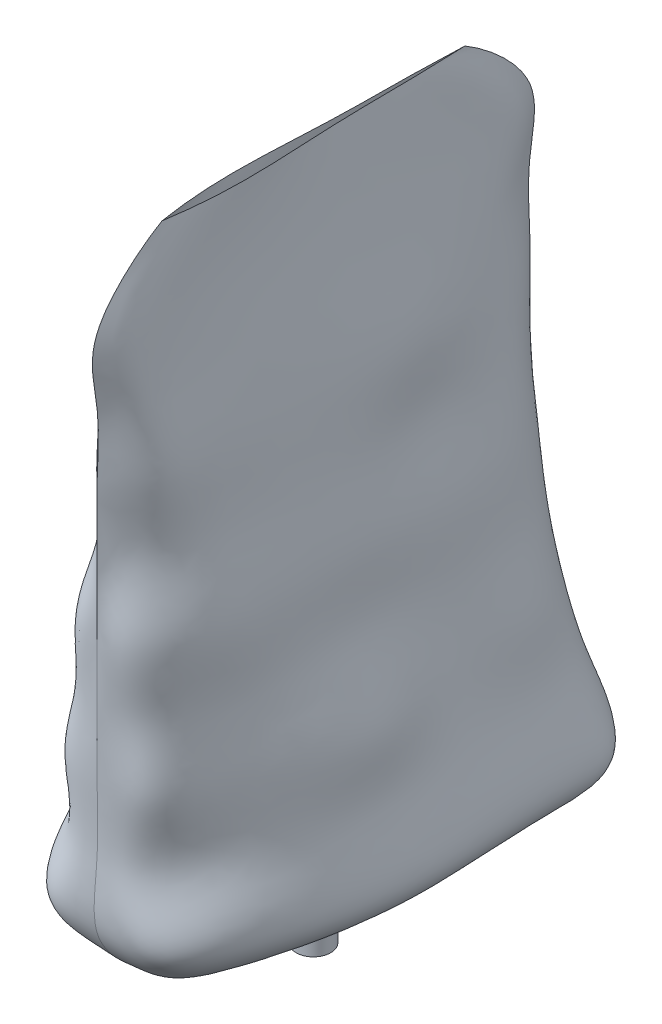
ISO-10303-21;
HEADER;
FILE_DESCRIPTION(('STEP AP214'),'2;1');
FILE_NAME('part.step','',(''),(''),'','','');
FILE_SCHEMA(('AUTOMOTIVE_DESIGN { 1 0 10303 214 1 1 1 1 }'));
ENDSEC;
DATA;
#1=APPLICATION_CONTEXT('core data for automotive mechanical design processes');
#2=APPLICATION_PROTOCOL_DEFINITION('international standard','automotive_design',2000,#1);
#3=PRODUCT_CONTEXT('',#1,'mechanical');
#4=PRODUCT('Part','Part','',(#3));
#5=PRODUCT_RELATED_PRODUCT_CATEGORY('part','',(#4));
#6=PRODUCT_DEFINITION_FORMATION('','',#4);
#7=PRODUCT_DEFINITION_CONTEXT('part definition',#1,'design');
#8=PRODUCT_DEFINITION('design','',#6,#7);
#9=PRODUCT_DEFINITION_SHAPE('','',#8);
#10=(LENGTH_UNIT() NAMED_UNIT(*) SI_UNIT(.MILLI.,.METRE.));
#11=(NAMED_UNIT(*) PLANE_ANGLE_UNIT() SI_UNIT($,.RADIAN.));
#12=(NAMED_UNIT(*) SI_UNIT($,.STERADIAN.) SOLID_ANGLE_UNIT());
#13=UNCERTAINTY_MEASURE_WITH_UNIT(LENGTH_MEASURE(1.E-05),#10,'distance_accuracy_value','');
#14=(GEOMETRIC_REPRESENTATION_CONTEXT(3) GLOBAL_UNCERTAINTY_ASSIGNED_CONTEXT((#13)) GLOBAL_UNIT_ASSIGNED_CONTEXT((#10,
#11,#12)) REPRESENTATION_CONTEXT('',''));
#15=CARTESIAN_POINT('',(0.,0.,0.));
#16=DIRECTION('',(0.,0.,1.));
#17=DIRECTION('',(1.,0.,0.));
#18=AXIS2_PLACEMENT_3D('',#15,#16,#17);
#19=CARTESIAN_POINT('',(0.,-110.49,0.));
#20=DIRECTION('',(0.,1.,0.));
#21=DIRECTION('',(0.,0.,1.));
#22=AXIS2_PLACEMENT_3D('',#19,#20,#21);
#23=CYLINDRICAL_SURFACE('',#22,5.08);
#24=CARTESIAN_POINT('',(0.,-110.49,0.));
#25=DIRECTION('',(0.,1.,0.));
#26=DIRECTION('',(0.,0.,1.));
#27=AXIS2_PLACEMENT_3D('',#24,#25,#26);
#28=CIRCLE('',#27,5.08);
#29=CARTESIAN_POINT('',(0.,-110.49,5.08));
#30=VERTEX_POINT('',#29);
#31=EDGE_CURVE('E12',#30,#30,#28,.T.);
#32=ORIENTED_EDGE('',*,*,#31,.T.);
#33=EDGE_LOOP('',(#32));
#34=FACE_BOUND('',#33,.T.);
#35=CARTESIAN_POINT('',(0.,-95.25,0.));
#36=DIRECTION('',(0.,1.,0.));
#37=DIRECTION('',(0.,0.,1.));
#38=AXIS2_PLACEMENT_3D('',#35,#36,#37);
#39=CIRCLE('',#38,5.08);
#40=CARTESIAN_POINT('',(0.,-95.25,5.08));
#41=VERTEX_POINT('',#40);
#42=EDGE_CURVE('E151',#41,#41,#39,.T.);
#43=ORIENTED_EDGE('',*,*,#42,.F.);
#44=EDGE_LOOP('',(#43));
#45=FACE_BOUND('',#44,.T.);
#46=ADVANCED_FACE('F145',(#34,#45),#23,.T.);
#47=CARTESIAN_POINT('',(0.,-110.49,0.));
#48=DIRECTION('',(0.,1.,0.));
#49=DIRECTION('',(0.,0.,1.));
#50=AXIS2_PLACEMENT_3D('',#47,#48,#49);
#51=PLANE('',#50);
#52=ORIENTED_EDGE('',*,*,#31,.F.);
#53=EDGE_LOOP('',(#52));
#54=FACE_BOUND('',#53,.T.);
#55=ADVANCED_FACE('F160',(#54),#51,.F.);
#56=CARTESIAN_POINT('',(0.,-95.25,0.));
#57=DIRECTION('',(0.,1.,0.));
#58=DIRECTION('',(0.,0.,1.));
#59=AXIS2_PLACEMENT_3D('',#56,#57,#58);
#60=PLANE('',#59);
#61=ORIENTED_EDGE('',*,*,#42,.T.);
#62=EDGE_LOOP('',(#61));
#63=FACE_BOUND('',#62,.T.);
#64=ADVANCED_FACE('F157',(#63),#60,.T.);
#65=CLOSED_SHELL('',(#46,#55,#64));
#66=MANIFOLD_SOLID_BREP('B2',#65);
#67=CARTESIAN_POINT('',(0.,-95.25,-44.45));
#68=DIRECTION('',(0.,-1.,0.));
#69=DIRECTION('',(0.,0.,1.));
#70=AXIS2_PLACEMENT_3D('',#67,#68,#69);
#71=PLANE('',#70);
#72=CARTESIAN_POINT('',(0.,-95.25,-44.45));
#73=CARTESIAN_POINT('',(0.311432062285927,-95.25,-42.9520474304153));
#74=CARTESIAN_POINT('',(0.856523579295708,-95.25,-40.3302196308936));
#75=CARTESIAN_POINT('',(1.47396422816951,-95.25,-37.2627937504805));
#76=CARTESIAN_POINT('',(1.81352175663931,-95.25,-35.5159116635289));
#77=CARTESIAN_POINT('',(1.98040515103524,-95.25,-34.6430239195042));
#78=CARTESIAN_POINT('',(2.15142375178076,-95.25,-33.7374742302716));
#79=CARTESIAN_POINT('',(2.31874124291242,-95.25,-32.8310901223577));
#80=CARTESIAN_POINT('',(2.56725062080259,-95.25,-31.4524413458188));
#81=CARTESIAN_POINT('',(2.8175789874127,-95.25,-30.01393405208));
#82=CARTESIAN_POINT('',(3.12339431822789,-95.25,-28.1470549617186));
#83=CARTESIAN_POINT('',(3.37604747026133,-95.25,-26.5019966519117));
#84=CARTESIAN_POINT('',(3.58114598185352,-95.25,-25.0637110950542));
#85=CARTESIAN_POINT('',(3.75624330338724,-95.25,-23.7540458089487));
#86=CARTESIAN_POINT('',(3.88238939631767,-95.25,-22.7420876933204));
#87=CARTESIAN_POINT('',(4.15743218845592,-95.25,-20.3814147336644));
#88=CARTESIAN_POINT('',(4.41107229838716,-95.25,-17.6349197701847));
#89=CARTESIAN_POINT('',(4.61342264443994,-95.25,-14.2676512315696));
#90=CARTESIAN_POINT('',(4.70759748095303,-95.25,-11.9529512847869));
#91=CARTESIAN_POINT('',(4.76045029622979,-95.25,-9.84224425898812));
#92=CARTESIAN_POINT('',(4.80031717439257,-95.25,-6.49228169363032));
#93=CARTESIAN_POINT('',(4.75592379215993,-95.25,-3.34092238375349));
#94=CARTESIAN_POINT('',(4.66425991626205,-95.25,-0.597500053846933));
#95=CARTESIAN_POINT('',(4.594701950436,-95.25,1.21052219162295));
#96=CARTESIAN_POINT('',(4.45118418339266,-95.25,4.17950718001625));
#97=CARTESIAN_POINT('',(4.26268198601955,-95.25,7.068623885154));
#98=CARTESIAN_POINT('',(3.91445198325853,-95.25,11.7826925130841));
#99=CARTESIAN_POINT('',(3.59118472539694,-95.25,15.4245679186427));
#100=CARTESIAN_POINT('',(3.26377226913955,-95.25,20.4081644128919));
#101=CARTESIAN_POINT('',(3.15333321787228,-95.25,22.7058969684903));
#102=CARTESIAN_POINT('',(3.08539899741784,-95.25,25.6896324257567));
#103=CARTESIAN_POINT('',(3.084226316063,-95.25,27.5298447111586));
#104=CARTESIAN_POINT('',(3.14899621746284,-95.25,29.6824188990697));
#105=CARTESIAN_POINT('',(3.22762599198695,-95.25,31.2824044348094));
#106=CARTESIAN_POINT('',(3.35225743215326,-95.25,32.9136369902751));
#107=CARTESIAN_POINT('',(3.4288953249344,-95.25,34.4974954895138));
#108=CARTESIAN_POINT('',(3.4237116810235,-95.25,35.9453165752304));
#109=CARTESIAN_POINT('',(3.29330222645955,-95.25,37.1361554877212));
#110=CARTESIAN_POINT('',(3.10689823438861,-95.25,38.0057394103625));
#111=CARTESIAN_POINT('',(2.95729774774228,-95.25,38.5637862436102));
#112=CARTESIAN_POINT('',(2.72681520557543,-95.25,39.2707150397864));
#113=CARTESIAN_POINT('',(2.41877378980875,-95.25,40.051638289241));
#114=CARTESIAN_POINT('',(2.03588516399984,-95.25,40.8811727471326));
#115=CARTESIAN_POINT('',(1.28171421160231,-95.25,42.3491458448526));
#116=CARTESIAN_POINT('',(0.564248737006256,-95.25,43.5251414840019));
#117=CARTESIAN_POINT('',(0.,-95.25,44.45));
#118=B_SPLINE_CURVE_WITH_KNOTS('',3,(#72,#73,#74,#75,#76,#77,#78,#79,#80,#81,#82,#83,#84,#85,
#86,#87,#88,#89,#90,#91,#92,#93,#94,#95,#96,#97,#98,#99,#100,#101,#102,#103,#104,#105,#106,#107,
#108,#109,#110,#111,#112,#113,#114,#115,#116,#117),.UNSPECIFIED.,.F.,.F.,(4,1,1,1,1,1,1,1,1,1,1,
1,1,1,1,1,1,1,1,1,1,1,1,1,1,1,1,1,1,1,1,1,1,1,1,1,1,1,1,1,1,1,1,4),(0.,0.0508820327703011,
0.0890575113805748,0.104113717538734,0.110126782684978,0.118650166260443,0.134805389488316,
0.140831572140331,0.165329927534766,0.183476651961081,0.203921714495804,0.220857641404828,
0.231962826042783,0.248026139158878,0.254900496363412,0.311301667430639,0.340062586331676,
0.367361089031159,0.388478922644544,0.410362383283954,0.478857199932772,0.493267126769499,
0.501651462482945,0.539037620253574,0.592158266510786,0.598103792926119,0.696790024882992,
0.714567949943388,0.765147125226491,0.77361973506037,0.813929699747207,0.826206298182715,
0.844666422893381,0.866562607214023,0.879608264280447,0.896880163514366,0.914864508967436,
0.920271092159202,0.927240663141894,0.934567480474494,0.945530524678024,0.955535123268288,
0.965030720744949,1.),.UNSPECIFIED.);
#119=CARTESIAN_POINT('',(0.,-95.25,-44.45));
#120=VERTEX_POINT('',#119);
#121=CARTESIAN_POINT('',(0.,-95.25,44.45));
#122=VERTEX_POINT('',#121);
#123=EDGE_CURVE('E143',#120,#122,#118,.T.);
#124=ORIENTED_EDGE('',*,*,#123,.T.);
#125=CARTESIAN_POINT('',(0.,-95.25,-44.45));
#126=CARTESIAN_POINT('',(-0.311432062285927,-95.25,-42.9520474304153));
#127=CARTESIAN_POINT('',(-0.856523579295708,-95.25,-40.3302196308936));
#128=CARTESIAN_POINT('',(-1.47396422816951,-95.25,-37.2627937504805));
#129=CARTESIAN_POINT('',(-1.81352175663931,-95.25,-35.5159116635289));
#130=CARTESIAN_POINT('',(-1.98040515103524,-95.25,-34.6430239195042));
#131=CARTESIAN_POINT('',(-2.15142375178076,-95.25,-33.7374742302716));
#132=CARTESIAN_POINT('',(-2.31874124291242,-95.25,-32.8310901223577));
#133=CARTESIAN_POINT('',(-2.56725062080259,-95.25,-31.4524413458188));
#134=CARTESIAN_POINT('',(-2.8175789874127,-95.25,-30.01393405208));
#135=CARTESIAN_POINT('',(-3.12339431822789,-95.25,-28.1470549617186));
#136=CARTESIAN_POINT('',(-3.37604747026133,-95.25,-26.5019966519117));
#137=CARTESIAN_POINT('',(-3.58114598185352,-95.25,-25.0637110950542));
#138=CARTESIAN_POINT('',(-3.75624330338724,-95.25,-23.7540458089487));
#139=CARTESIAN_POINT('',(-3.88238939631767,-95.25,-22.7420876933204));
#140=CARTESIAN_POINT('',(-4.15743218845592,-95.25,-20.3814147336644));
#141=CARTESIAN_POINT('',(-4.41107229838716,-95.25,-17.6349197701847));
#142=CARTESIAN_POINT('',(-4.61342264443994,-95.25,-14.2676512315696));
#143=CARTESIAN_POINT('',(-4.70759748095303,-95.25,-11.9529512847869));
#144=CARTESIAN_POINT('',(-4.76045029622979,-95.25,-9.84224425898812));
#145=CARTESIAN_POINT('',(-4.80031717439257,-95.25,-6.49228169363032));
#146=CARTESIAN_POINT('',(-4.75592379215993,-95.25,-3.34092238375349));
#147=CARTESIAN_POINT('',(-4.66425991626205,-95.25,-0.597500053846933));
#148=CARTESIAN_POINT('',(-4.594701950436,-95.25,1.21052219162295));
#149=CARTESIAN_POINT('',(-4.45118418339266,-95.25,4.17950718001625));
#150=CARTESIAN_POINT('',(-4.26268198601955,-95.25,7.068623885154));
#151=CARTESIAN_POINT('',(-3.91445198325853,-95.25,11.7826925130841));
#152=CARTESIAN_POINT('',(-3.59118472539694,-95.25,15.4245679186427));
#153=CARTESIAN_POINT('',(-3.26377226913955,-95.25,20.4081644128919));
#154=CARTESIAN_POINT('',(-3.15333321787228,-95.25,22.7058969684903));
#155=CARTESIAN_POINT('',(-3.08539899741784,-95.25,25.6896324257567));
#156=CARTESIAN_POINT('',(-3.084226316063,-95.25,27.5298447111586));
#157=CARTESIAN_POINT('',(-3.14899621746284,-95.25,29.6824188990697));
#158=CARTESIAN_POINT('',(-3.22762599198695,-95.25,31.2824044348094));
#159=CARTESIAN_POINT('',(-3.35225743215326,-95.25,32.9136369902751));
#160=CARTESIAN_POINT('',(-3.4288953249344,-95.25,34.4974954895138));
#161=CARTESIAN_POINT('',(-3.4237116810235,-95.25,35.9453165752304));
#162=CARTESIAN_POINT('',(-3.29330222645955,-95.25,37.1361554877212));
#163=CARTESIAN_POINT('',(-3.10689823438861,-95.25,38.0057394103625));
#164=CARTESIAN_POINT('',(-2.95729774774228,-95.25,38.5637862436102));
#165=CARTESIAN_POINT('',(-2.72681520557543,-95.25,39.2707150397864));
#166=CARTESIAN_POINT('',(-2.41877378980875,-95.25,40.051638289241));
#167=CARTESIAN_POINT('',(-2.03588516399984,-95.25,40.8811727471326));
#168=CARTESIAN_POINT('',(-1.28171421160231,-95.25,42.3491458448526));
#169=CARTESIAN_POINT('',(-0.564248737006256,-95.25,43.5251414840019));
#170=CARTESIAN_POINT('',(0.,-95.25,44.45));
#171=B_SPLINE_CURVE_WITH_KNOTS('',3,(#125,#126,#127,#128,#129,#130,#131,#132,#133,#134,#135,
#136,#137,#138,#139,#140,#141,#142,#143,#144,#145,#146,#147,#148,#149,#150,#151,#152,#153,#154,
#155,#156,#157,#158,#159,#160,#161,#162,#163,#164,#165,#166,#167,#168,#169,#170),.UNSPECIFIED.,
.F.,.F.,(4,1,1,1,1,1,1,1,1,1,1,1,1,1,1,1,1,1,1,1,1,1,1,1,1,1,1,1,1,1,1,1,1,1,1,1,1,1,1,1,1,1,1,
4),(0.,0.0508820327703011,0.0890575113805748,0.104113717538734,0.110126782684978,
0.118650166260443,0.134805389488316,0.140831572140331,0.165329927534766,0.183476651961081,
0.203921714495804,0.220857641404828,0.231962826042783,0.248026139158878,0.254900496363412,
0.311301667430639,0.340062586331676,0.367361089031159,0.388478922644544,0.410362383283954,
0.478857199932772,0.493267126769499,0.501651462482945,0.539037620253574,0.592158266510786,
0.598103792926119,0.696790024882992,0.714567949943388,0.765147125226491,0.77361973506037,
0.813929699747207,0.826206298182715,0.844666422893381,0.866562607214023,0.879608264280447,
0.896880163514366,0.914864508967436,0.920271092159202,0.927240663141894,0.934567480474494,
0.945530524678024,0.955535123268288,0.965030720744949,1.),.UNSPECIFIED.);
#172=EDGE_CURVE('E195',#122,#120,#171,.F.);
#173=ORIENTED_EDGE('',*,*,#172,.T.);
#174=EDGE_LOOP('',(#124,#173));
#175=FACE_BOUND('',#174,.T.);
#176=ADVANCED_FACE('F194',(#175),#71,.T.);
#177=OPEN_SHELL('',(#176));
#178=SHELL_BASED_SURFACE_MODEL('B7',(#177));
#179=CARTESIAN_POINT('',(0.,95.25,44.45));
#180=CARTESIAN_POINT('',(0.,91.8633333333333,50.3766666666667));
#181=CARTESIAN_POINT('',(0.,77.2877049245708,68.546540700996));
#182=CARTESIAN_POINT('',(0.,57.1940583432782,62.2540476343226));
#183=CARTESIAN_POINT('',(0.,38.2205743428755,63.8309265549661));
#184=CARTESIAN_POINT('',(0.,18.9112362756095,63.4071742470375));
#185=CARTESIAN_POINT('',(0.,0.178263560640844,63.5384061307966));
#186=CARTESIAN_POINT('',(0.,-19.4428340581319,63.4382234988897));
#187=CARTESIAN_POINT('',(0.,-37.8231881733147,63.7128524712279));
#188=CARTESIAN_POINT('',(0.,-57.126357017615,62.7268108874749));
#189=CARTESIAN_POINT('',(0.,-81.3730336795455,67.2072549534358));
#190=CARTESIAN_POINT('',(0.,-91.8633333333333,50.3766666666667));
#191=CARTESIAN_POINT('',(0.,-95.25,44.45));
#192=CARTESIAN_POINT('',(-0.156471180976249,95.25,43.4243692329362));
#193=CARTESIAN_POINT('',(-0.266700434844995,91.8364353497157,49.236301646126));
#194=CARTESIAN_POINT('',(-0.668483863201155,77.2980489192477,67.0343065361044));
#195=CARTESIAN_POINT('',(-1.08747004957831,57.1915033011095,61.1211285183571));
#196=CARTESIAN_POINT('',(-1.26979565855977,38.2212574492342,62.8156663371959));
#197=CARTESIAN_POINT('',(-0.951317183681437,18.9110281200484,61.9123016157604));
#198=CARTESIAN_POINT('',(-1.89920434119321,0.178409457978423,63.9594397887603));
#199=CARTESIAN_POINT('',(-1.63298822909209,-19.4432118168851,62.9597479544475));
#200=CARTESIAN_POINT('',(-2.04066021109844,-37.8217922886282,63.7596553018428));
#201=CARTESIAN_POINT('',(-1.75612588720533,-57.1314539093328,62.7064682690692));
#202=CARTESIAN_POINT('',(-2.56482772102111,-81.3485862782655,67.6374967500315));
#203=CARTESIAN_POINT('',(-1.07198302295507,-91.9498783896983,49.7525402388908));
#204=CARTESIAN_POINT('',(-0.564248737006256,-95.25,43.5251414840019));
#205=CARTESIAN_POINT('',(-0.355208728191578,95.2500000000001,42.1201951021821));
#206=CARTESIAN_POINT('',(-0.605599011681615,91.8022334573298,47.7862381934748));
#207=CARTESIAN_POINT('',(-1.51857395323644,77.3112017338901,65.1114549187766));
#208=CARTESIAN_POINT('',(-2.47021186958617,57.1882544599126,59.6805712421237));
#209=CARTESIAN_POINT('',(-2.88439864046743,38.2221260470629,61.5247222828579));
#210=CARTESIAN_POINT('',(-2.16095460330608,18.9107634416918,60.011509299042));
#211=CARTESIAN_POINT('',(-4.31412116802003,0.178594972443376,64.4948014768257));
#212=CARTESIAN_POINT('',(-3.70939981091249,-19.4436921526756,62.3513466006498));
#213=CARTESIAN_POINT('',(-4.63544362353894,-37.8200173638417,63.8191670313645));
#214=CARTESIAN_POINT('',(-3.98911216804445,-57.1379348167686,62.6806017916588));
#215=CARTESIAN_POINT('',(-5.82611165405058,-81.3175004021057,68.1845668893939));
#216=CARTESIAN_POINT('',(-2.43505352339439,-92.0599239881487,48.9589378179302));
#217=CARTESIAN_POINT('',(-1.28171421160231,-95.25,42.3491458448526));
#218=CARTESIAN_POINT('',(-0.574364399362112,95.25,40.518650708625));
#219=CARTESIAN_POINT('',(-0.94538041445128,91.7578640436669,45.9986094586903));
#220=CARTESIAN_POINT('',(-2.31574772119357,77.3282647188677,62.7138491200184));
#221=CARTESIAN_POINT('',(-3.81416496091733,57.1840394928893,57.7869860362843));
#222=CARTESIAN_POINT('',(-4.7431381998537,38.223254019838,59.8218278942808));
#223=CARTESIAN_POINT('',(-3.60039069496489,18.9104157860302,57.911928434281));
#224=CARTESIAN_POINT('',(-6.8262532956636,0.178851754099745,63.9098432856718));
#225=CARTESIAN_POINT('',(-5.9849567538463,-19.444375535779,61.3539293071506));
#226=CARTESIAN_POINT('',(-7.5908252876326,-37.8174845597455,63.6799943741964));
#227=CARTESIAN_POINT('',(-6.42326609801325,-57.1471849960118,61.6868200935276));
#228=CARTESIAN_POINT('',(-9.74112703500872,-81.2731309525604,68.8002466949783));
#229=CARTESIAN_POINT('',(-3.95835832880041,-92.2169943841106,47.9006054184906));
#230=CARTESIAN_POINT('',(-2.03588516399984,-95.25,40.8811727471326));
#231=CARTESIAN_POINT('',(-0.691186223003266,95.25,39.622076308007));
#232=CARTESIAN_POINT('',(-1.11150807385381,91.7320940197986,44.9955253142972));
#233=CARTESIAN_POINT('',(-2.68301520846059,77.3381749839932,61.3599380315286));
#234=CARTESIAN_POINT('',(-4.45647173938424,57.1815914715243,56.6854075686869));
#235=CARTESIAN_POINT('',(-5.7485865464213,38.2239089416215,58.8409142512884));
#236=CARTESIAN_POINT('',(-4.38023617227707,18.9102146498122,56.7742371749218));
#237=CARTESIAN_POINT('',(-8.137202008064,0.178997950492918,63.3265488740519));
#238=CARTESIAN_POINT('',(-7.1615774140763,-19.444761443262,60.6813909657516));
#239=CARTESIAN_POINT('',(-9.17728290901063,-37.816055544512,63.5454231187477));
#240=CARTESIAN_POINT('',(-7.69005547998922,-57.1524036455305,60.8288914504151));
#241=CARTESIAN_POINT('',(-11.9048512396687,-81.2480992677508,69.1265726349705));
#242=CARTESIAN_POINT('',(-4.76918468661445,-92.3056079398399,47.2897664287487));
#243=CARTESIAN_POINT('',(-2.41877378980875,-95.25,40.051638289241));
#244=CARTESIAN_POINT('',(-0.79397569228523,95.25,38.7885117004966));
#245=CARTESIAN_POINT('',(-1.24232451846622,91.7073486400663,44.0609125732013));
#246=CARTESIAN_POINT('',(-2.94714582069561,77.3476911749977,60.0916621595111));
#247=CARTESIAN_POINT('',(-4.91392672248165,57.1792408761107,55.6070565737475));
#248=CARTESIAN_POINT('',(-6.64461089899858,38.2245374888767,57.902818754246));
#249=CARTESIAN_POINT('',(-5.06365860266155,18.9100227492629,55.734004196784));
#250=CARTESIAN_POINT('',(-9.27649464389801,0.179133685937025,62.5771697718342));
#251=CARTESIAN_POINT('',(-8.12940450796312,-19.4451146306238,59.8959590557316));
#252=CARTESIAN_POINT('',(-10.5615888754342,-37.8147497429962,63.3227772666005));
#253=CARTESIAN_POINT('',(-8.78938045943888,-57.1571717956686,59.7925407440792));
#254=CARTESIAN_POINT('',(-13.8650580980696,-81.2252286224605,69.3473673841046));
#255=CARTESIAN_POINT('',(-5.46975165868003,-92.3865712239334,46.6906198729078));
#256=CARTESIAN_POINT('',(-2.72681520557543,-95.25,39.2707150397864));
#257=CARTESIAN_POINT('',(-0.881308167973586,95.25,38.0437676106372));
#258=CARTESIAN_POINT('',(-1.34618274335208,91.6853143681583,43.2255332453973));
#259=CARTESIAN_POINT('',(-3.14449487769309,77.3561647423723,58.9576010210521));
#260=CARTESIAN_POINT('',(-5.18362831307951,57.1771478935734,54.5897105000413));
#261=CARTESIAN_POINT('',(-7.41233860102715,38.2250968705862,57.0446444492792));
#262=CARTESIAN_POINT('',(-5.63110978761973,18.9098529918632,54.8055863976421));
#263=CARTESIAN_POINT('',(-10.2347705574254,0.17925035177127,61.770406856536));
#264=CARTESIAN_POINT('',(-8.91303944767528,-19.4454134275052,59.0946160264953));
#265=CARTESIAN_POINT('',(-11.6973544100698,-37.8136469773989,62.9959576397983));
#266=CARTESIAN_POINT('',(-9.72826122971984,-57.1611980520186,58.7385707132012));
#267=CARTESIAN_POINT('',(-15.5546066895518,-81.2059166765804,69.4230670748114));
#268=CARTESIAN_POINT('',(-6.0453487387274,-92.4549364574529,46.120894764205));
#269=CARTESIAN_POINT('',(-2.95729774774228,-95.25,38.5637862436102));
#270=CARTESIAN_POINT('',(-0.946735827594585,95.25,37.4625067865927));
#271=CARTESIAN_POINT('',(-1.41945695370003,91.6681589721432,42.5731728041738));
#272=CARTESIAN_POINT('',(-3.27498929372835,77.3627620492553,58.0712262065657));
#273=CARTESIAN_POINT('',(-5.32225528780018,57.1755184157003,53.7678259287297));
#274=CARTESIAN_POINT('',(-7.9838903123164,38.2255321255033,56.3602388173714));
#275=CARTESIAN_POINT('',(-6.0447122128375,18.9097218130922,54.0768568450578));
#276=CARTESIAN_POINT('',(-10.9469115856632,0.179337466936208,61.0667373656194));
#277=CARTESIAN_POINT('',(-9.48230931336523,-19.4456321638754,58.4187133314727));
#278=CARTESIAN_POINT('',(-12.5097871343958,-37.8128415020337,62.6417560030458));
#279=CARTESIAN_POINT('',(-10.4418829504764,-57.1641384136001,57.8614333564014));
#280=CARTESIAN_POINT('',(-16.8267639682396,-81.191813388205,69.3848076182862));
#281=CARTESIAN_POINT('',(-6.46029665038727,-92.5048627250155,45.6508624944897));
#282=CARTESIAN_POINT('',(-3.10689823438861,-95.25,38.0057394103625));
#283=CARTESIAN_POINT('',(-1.04397067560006,95.25,36.5664036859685));
#284=CARTESIAN_POINT('',(-1.52225093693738,91.641728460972,41.566819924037));
#285=CARTESIAN_POINT('',(-3.44464819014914,77.3729261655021,56.7020955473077));
#286=CARTESIAN_POINT('',(-5.4568249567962,57.1730080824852,52.4701627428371));
#287=CARTESIAN_POINT('',(-8.81694534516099,38.2262022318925,55.2817288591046));
#288=CARTESIAN_POINT('',(-6.64509640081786,18.9095214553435,52.9451175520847));
#289=CARTESIAN_POINT('',(-11.9977191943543,0.179465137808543,59.8966597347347));
#290=CARTESIAN_POINT('',(-10.3071000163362,-19.4459446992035,57.314384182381));
#291=CARTESIAN_POINT('',(-13.6696438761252,-37.811694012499,61.9681809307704));
#292=CARTESIAN_POINT('',(-11.5198172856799,-57.168326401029,56.457833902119));
#293=CARTESIAN_POINT('',(-18.7175187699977,-81.1717262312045,69.1705932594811));
#294=CARTESIAN_POINT('',(-7.04975288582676,-92.5759720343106,44.8867178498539));
#295=CARTESIAN_POINT('',(-3.29330222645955,-95.25,37.1361554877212));
#296=CARTESIAN_POINT('',(-1.16514990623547,95.25,35.3651748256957));
#297=CARTESIAN_POINT('',(-1.63473698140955,91.6062517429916,40.2158820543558));
#298=CARTESIAN_POINT('',(-3.59180363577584,77.3865689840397,54.8580178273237));
#299=CARTESIAN_POINT('',(-5.47038678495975,57.1696388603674,50.6664904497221));
#300=CARTESIAN_POINT('',(-9.78742087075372,38.2271005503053,53.7675315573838));
#301=CARTESIAN_POINT('',(-7.36864431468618,18.9092567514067,51.407404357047));
#302=CARTESIAN_POINT('',(-13.286047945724,0.179620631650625,58.1373831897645));
#303=CARTESIAN_POINT('',(-11.2865579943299,-19.4463048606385,55.6857128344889));
#304=CARTESIAN_POINT('',(-15.0029963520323,-37.8103805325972,60.7546639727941));
#305=CARTESIAN_POINT('',(-12.910500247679,-57.1731178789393,54.4770229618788));
#306=CARTESIAN_POINT('',(-21.0793304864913,-81.1487453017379,68.494762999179));
#307=CARTESIAN_POINT('',(-7.70852120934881,-92.6573250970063,43.7623187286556));
#308=CARTESIAN_POINT('',(-3.4237116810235,-95.25,35.9453165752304));
#309=CARTESIAN_POINT('',(-1.29300794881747,95.25,33.936682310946));
#310=CARTESIAN_POINT('',(-1.72619899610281,91.5633686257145,38.6042906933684));
#311=CARTESIAN_POINT('',(-3.62011166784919,77.4030597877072,52.6372403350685));
#312=CARTESIAN_POINT('',(-5.38638277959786,57.1655668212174,48.4854244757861));
#313=CARTESIAN_POINT('',(-10.5361064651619,38.2281842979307,51.7909031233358));
#314=CARTESIAN_POINT('',(-8.15097139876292,18.9089446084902,49.5377988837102));
#315=CARTESIAN_POINT('',(-14.5983705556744,0.179779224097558,55.8541140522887));
#316=CARTESIAN_POINT('',(-12.2697297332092,-19.4466304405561,53.5389453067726));
#317=CARTESIAN_POINT('',(-16.2684041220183,-37.8092122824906,58.8274984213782));
#318=CARTESIAN_POINT('',(-14.4832436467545,-57.1773745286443,52.1273915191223));
#319=CARTESIAN_POINT('',(-23.5899163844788,-81.128331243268,67.0151806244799));
#320=CARTESIAN_POINT('',(-8.30962197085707,-92.7295906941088,42.2627797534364));
#321=CARTESIAN_POINT('',(-3.4288953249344,-95.25,34.4974954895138));
#322=CARTESIAN_POINT('',(-1.41637297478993,95.25,32.3912666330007));
#323=CARTESIAN_POINT('',(-1.7889790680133,91.5159035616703,36.8547259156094));
#324=CARTESIAN_POINT('',(-3.52910214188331,77.4213124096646,50.2059599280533));
#325=CARTESIAN_POINT('',(-5.32905357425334,57.1610602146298,46.1394223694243));
#326=CARTESIAN_POINT('',(-11.0288790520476,38.2293819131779,49.5268139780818));
#327=CARTESIAN_POINT('',(-8.93427633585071,18.9086062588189,47.4500068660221));
#328=CARTESIAN_POINT('',(-15.8233603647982,0.179927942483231,53.3482632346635));
#329=CARTESIAN_POINT('',(-13.2004125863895,-19.4468905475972,51.068724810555));
#330=CARTESIAN_POINT('',(-17.4087618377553,-37.8083023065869,56.3575091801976));
#331=CARTESIAN_POINT('',(-16.1235473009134,-57.1806838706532,49.7545370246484));
#332=CARTESIAN_POINT('',(-26.0390451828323,-81.1124624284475,64.8047210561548));
#333=CARTESIAN_POINT('',(-8.83790065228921,-92.7857653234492,40.502569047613));
#334=CARTESIAN_POINT('',(-3.35225743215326,-95.25,32.9136369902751));
#335=CARTESIAN_POINT('',(-1.52513721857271,95.25,30.809450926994));
#336=CARTESIAN_POINT('',(-1.81377932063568,91.4657848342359,35.0556626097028));
#337=CARTESIAN_POINT('',(-3.30550039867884,77.4405853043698,47.6809002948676));
#338=CARTESIAN_POINT('',(-5.42256590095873,57.1563022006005,43.7963281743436));
#339=CARTESIAN_POINT('',(-11.2123905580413,38.2306444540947,47.0942892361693));
#340=CARTESIAN_POINT('',(-9.66999831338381,18.9082565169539,45.2145212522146));
#341=CARTESIAN_POINT('',(-16.856786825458,0.180056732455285,50.8586596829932));
#342=CARTESIAN_POINT('',(-14.0259586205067,-19.4470596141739,48.3980539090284));
#343=CARTESIAN_POINT('',(-18.3759972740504,-37.8077448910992,53.4846957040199));
#344=CARTESIAN_POINT('',(-17.7131063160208,-57.1827016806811,47.4784795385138));
#345=CARTESIAN_POINT('',(-28.2539691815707,-81.1027899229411,61.9278646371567));
#346=CARTESIAN_POINT('',(-9.27891789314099,-92.820004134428,38.5661088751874));
#347=CARTESIAN_POINT('',(-3.22762599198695,-95.25,31.2824044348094));
#348=CARTESIAN_POINT('',(-1.61267602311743,95.25,29.249446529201));
#349=CARTESIAN_POINT('',(-1.82087818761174,91.4172977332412,33.2770661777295));
#350=CARTESIAN_POINT('',(-3.0570185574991,77.4592305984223,45.1793759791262));
#351=CARTESIAN_POINT('',(-5.61015504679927,57.1516995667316,41.5240811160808));
#352=CARTESIAN_POINT('',(-11.2068691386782,38.2318641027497,44.6376646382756));
#353=CARTESIAN_POINT('',(-10.3144685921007,18.9079247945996,42.9206859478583));
#354=CARTESIAN_POINT('',(-17.6509234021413,0.180156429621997,48.4427077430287));
#355=CARTESIAN_POINT('',(-14.749786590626,-19.4471300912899,45.7378145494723));
#356=CARTESIAN_POINT('',(-19.234832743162,-37.8075613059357,50.4470065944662));
#357=CARTESIAN_POINT('',(-19.1459195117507,-57.183352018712,45.3242451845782));
#358=CARTESIAN_POINT('',(-30.1494040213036,-81.0996773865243,58.5872383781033));
#359=CARTESIAN_POINT('',(-9.68423430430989,-92.8310199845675,36.5569767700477));
#360=CARTESIAN_POINT('',(-3.14899621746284,-95.25,29.6824188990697));
#361=CARTESIAN_POINT('',(-1.71094205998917,95.25,27.1429958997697));
#362=CARTESIAN_POINT('',(-1.83277650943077,91.3546409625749,30.8749746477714));
#363=CARTESIAN_POINT('',(-2.78251391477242,77.4833246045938,41.8129906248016));
#364=CARTESIAN_POINT('',(-5.89767407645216,57.1457521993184,38.4724173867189));
#365=CARTESIAN_POINT('',(-11.1615025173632,38.233438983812,41.3248570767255));
#366=CARTESIAN_POINT('',(-11.0962710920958,18.9075005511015,39.7509897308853));
#367=CARTESIAN_POINT('',(-18.5144868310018,0.180268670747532,45.1834382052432));
#368=CARTESIAN_POINT('',(-15.6798106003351,-19.447159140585,42.2338919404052));
#369=CARTESIAN_POINT('',(-20.4171931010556,-37.8075610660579,46.3039985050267));
#370=CARTESIAN_POINT('',(-20.9081247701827,-57.1833250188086,42.4337828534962));
#371=CARTESIAN_POINT('',(-32.4684809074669,-81.0998164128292,53.7335621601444));
#372=CARTESIAN_POINT('',(-10.2071296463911,-92.8305240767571,33.7734904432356));
#373=CARTESIAN_POINT('',(-3.084226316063,-95.25,27.5298447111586));
#374=CARTESIAN_POINT('',(-1.76554911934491,95.25,25.332253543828));
#375=CARTESIAN_POINT('',(-1.8427634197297,91.3047166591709,28.8088572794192));
#376=CARTESIAN_POINT('',(-2.63705191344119,77.5025223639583,38.938728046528));
#377=CARTESIAN_POINT('',(-6.15386850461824,57.1410137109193,35.8544337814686));
#378=CARTESIAN_POINT('',(-11.2130319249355,38.2346926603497,38.5471707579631));
#379=CARTESIAN_POINT('',(-11.6288958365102,18.9071668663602,36.9266783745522));
#380=CARTESIAN_POINT('',(-18.9945788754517,0.180341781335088,42.3939008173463));
#381=CARTESIAN_POINT('',(-16.3685616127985,-19.4471212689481,39.2956542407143));
#382=CARTESIAN_POINT('',(-21.5858274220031,-37.8077940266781,42.8633914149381));
#383=CARTESIAN_POINT('',(-22.1360242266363,-57.1824501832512,39.8983078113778));
#384=CARTESIAN_POINT('',(-34.1648120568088,-81.1040208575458,49.2292754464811));
#385=CARTESIAN_POINT('',(-10.6256290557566,-92.8156368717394,31.3074852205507));
#386=CARTESIAN_POINT('',(-3.08539899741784,-95.25,25.6896324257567));
#387=CARTESIAN_POINT('',(-1.81354836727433,95.25,22.3857731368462));
#388=CARTESIAN_POINT('',(-1.85612611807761,91.2298172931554,25.4452244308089));
#389=CARTESIAN_POINT('',(-2.50779264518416,77.5313240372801,34.2833662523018));
#390=CARTESIAN_POINT('',(-6.58441930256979,57.1339045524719,31.6103437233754));
#391=CARTESIAN_POINT('',(-11.3628036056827,38.236574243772,34.075406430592));
#392=CARTESIAN_POINT('',(-12.4640137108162,18.9066634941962,32.3343901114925));
#393=CARTESIAN_POINT('',(-19.494009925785,0.180461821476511,37.8257568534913));
#394=CARTESIAN_POINT('',(-17.3174735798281,-19.4471031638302,34.5952543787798));
#395=CARTESIAN_POINT('',(-23.596901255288,-37.8079956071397,37.4507694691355));
#396=CARTESIAN_POINT('',(-23.7231586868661,-57.181679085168,35.5546781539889));
#397=CARTESIAN_POINT('',(-36.662458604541,-81.1077314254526,42.1377447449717));
#398=CARTESIAN_POINT('',(-11.277492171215,-92.8024965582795,27.34778742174));
#399=CARTESIAN_POINT('',(-3.15333321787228,-95.25,22.7058969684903));
#400=CARTESIAN_POINT('',(-1.81423534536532,95.25,20.1074487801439));
#401=CARTESIAN_POINT('',(-1.86389405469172,91.1779864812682,22.843013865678));
#402=CARTESIAN_POINT('',(-2.50245029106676,77.5512550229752,30.7030070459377));
#403=CARTESIAN_POINT('',(-6.9301531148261,57.1289848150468,28.3455813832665));
#404=CARTESIAN_POINT('',(-11.5263724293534,38.2378768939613,30.6518337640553));
#405=CARTESIAN_POINT('',(-13.115329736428,18.906312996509,28.8176132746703));
#406=CARTESIAN_POINT('',(-19.6386719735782,0.180553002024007,34.2569661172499));
#407=CARTESIAN_POINT('',(-17.8897406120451,-19.4471209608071,31.0329917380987));
#408=CARTESIAN_POINT('',(-25.2288970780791,-37.8080192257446,33.4325343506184));
#409=CARTESIAN_POINT('',(-24.5766258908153,-57.181569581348,31.9965488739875));
#410=CARTESIAN_POINT('',(-38.3516379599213,-81.1082646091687,36.8702886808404));
#411=CARTESIAN_POINT('',(-11.7530308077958,-92.8006059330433,24.3357208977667));
#412=CARTESIAN_POINT('',(-3.26377226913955,-95.25,20.4081644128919));
#413=CARTESIAN_POINT('',(-1.74416408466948,95.25,15.1538372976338));
#414=CARTESIAN_POINT('',(-1.8704702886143,91.0823257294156,17.1836156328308));
#415=CARTESIAN_POINT('',(-2.66066860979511,77.588040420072,22.9597214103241));
#416=CARTESIAN_POINT('',(-7.65908660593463,57.1199045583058,21.2839140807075));
#417=CARTESIAN_POINT('',(-11.9977713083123,38.2402819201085,23.2487893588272));
#418=CARTESIAN_POINT('',(-14.3147874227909,18.9056631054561,21.2658831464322));
#419=CARTESIAN_POINT('',(-19.8817962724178,0.180732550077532,26.3805323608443));
#420=CARTESIAN_POINT('',(-18.6633761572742,-19.4471959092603,23.3826918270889));
#421=CARTESIAN_POINT('',(-28.6041158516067,-37.8079019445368,25.0144312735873));
#422=CARTESIAN_POINT('',(-25.652720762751,-57.1819562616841,23.8182406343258));
#423=CARTESIAN_POINT('',(-41.4740866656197,-81.1064240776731,25.8613500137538));
#424=CARTESIAN_POINT('',(-12.7018740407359,-92.8071159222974,17.8893790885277));
#425=CARTESIAN_POINT('',(-3.59118472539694,-95.25,15.4245679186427));
#426=CARTESIAN_POINT('',(-1.61229344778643,95.25,11.5237088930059));
#427=CARTESIAN_POINT('',(-1.86042929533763,91.0346432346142,13.0350780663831));
#428=CARTESIAN_POINT('',(-2.95879643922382,77.6063763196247,17.3334986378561));
#429=CARTESIAN_POINT('',(-8.14068210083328,57.1153782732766,16.1521923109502));
#430=CARTESIAN_POINT('',(-12.4857232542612,38.241481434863,17.8543815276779));
#431=CARTESIAN_POINT('',(-14.8223763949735,18.9053364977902,15.8538865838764));
#432=CARTESIAN_POINT('',(-20.2050054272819,0.180832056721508,20.4504380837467));
#433=CARTESIAN_POINT('',(-18.6191431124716,-19.4472706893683,17.8600787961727));
#434=CARTESIAN_POINT('',(-30.6829937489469,-37.8077004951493,19.1853901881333));
#435=CARTESIAN_POINT('',(-25.6026255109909,-57.1826723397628,17.3468649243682));
#436=CARTESIAN_POINT('',(-43.0715770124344,-81.1029960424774,18.2823051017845));
#437=CARTESIAN_POINT('',(-13.2813294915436,-92.8192487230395,13.2789102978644));
#438=CARTESIAN_POINT('',(-3.91445198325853,-95.25,11.7826925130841));
#439=CARTESIAN_POINT('',(-1.40585679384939,95.25,6.84521080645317));
#440=CARTESIAN_POINT('',(-1.81550382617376,91.0000421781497,7.69295464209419));
#441=CARTESIAN_POINT('',(-3.35068249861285,77.61968192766,10.1187488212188));
#442=CARTESIAN_POINT('',(-8.58007574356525,57.1120935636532,9.56712250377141));
#443=CARTESIAN_POINT('',(-13.1365234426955,38.2423525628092,10.8277112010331));
#444=CARTESIAN_POINT('',(-14.8800011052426,18.9050969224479,8.97789167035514));
#445=CARTESIAN_POINT('',(-20.4854677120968,0.180913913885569,12.804504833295));
#446=CARTESIAN_POINT('',(-18.2020969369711,-19.4473610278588,10.5452513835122));
#447=CARTESIAN_POINT('',(-31.6272235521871,-37.8074164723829,11.7147453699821));
#448=CARTESIAN_POINT('',(-25.4662226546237,-57.1836964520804,8.92187478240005));
#449=CARTESIAN_POINT('',(-44.2948310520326,-81.0980882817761,8.66590588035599));
#450=CARTESIAN_POINT('',(-13.8136001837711,-92.8366207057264,7.36091614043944));
#451=CARTESIAN_POINT('',(-4.26268198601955,-95.25,7.068623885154));
#452=CARTESIAN_POINT('',(-1.26822271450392,95.25,3.98460970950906));
#453=CARTESIAN_POINT('',(-1.77663115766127,90.9879130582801,4.42828874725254));
#454=CARTESIAN_POINT('',(-3.58861039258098,77.624346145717,5.71916137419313));
#455=CARTESIAN_POINT('',(-8.78401312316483,57.1109420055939,5.55122947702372));
#456=CARTESIAN_POINT('',(-13.5377313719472,38.2426584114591,6.49968643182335));
#457=CARTESIAN_POINT('',(-14.7062334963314,18.9050111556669,4.80793882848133));
#458=CARTESIAN_POINT('',(-20.603566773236,0.180949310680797,8.13185861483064));
#459=CARTESIAN_POINT('',(-17.830096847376,-19.447417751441,5.9985655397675));
#460=CARTESIAN_POINT('',(-31.5791387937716,-37.8072211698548,7.15401481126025));
#461=CARTESIAN_POINT('',(-25.3767999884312,-57.1844058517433,3.75107379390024));
#462=CARTESIAN_POINT('',(-44.7532798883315,-81.0946868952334,2.82966213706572));
#463=CARTESIAN_POINT('',(-14.0645989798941,-92.8486612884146,3.74880736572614));
#464=CARTESIAN_POINT('',(-4.45118418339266,-95.25,4.17950718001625));
#465=CARTESIAN_POINT('',(-1.12573478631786,95.2500000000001,1.05149360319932));
#466=CARTESIAN_POINT('',(-1.71473636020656,90.988139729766,1.08511511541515));
#467=CARTESIAN_POINT('',(-3.77064031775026,77.6242591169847,1.22228428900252));
#468=CARTESIAN_POINT('',(-8.85599409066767,57.1109631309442,1.43965391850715));
#469=CARTESIAN_POINT('',(-13.9137036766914,38.2426541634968,1.99515226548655));
#470=CARTESIAN_POINT('',(-14.1686834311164,18.9050073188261,0.580299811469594));
#471=CARTESIAN_POINT('',(-20.4801027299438,0.180969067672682,3.35530701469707));
#472=CARTESIAN_POINT('',(-17.6368844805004,-19.4474930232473,1.29432889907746));
#473=CARTESIAN_POINT('',(-30.1024884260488,-37.8069331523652,2.34374829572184));
#474=CARTESIAN_POINT('',(-25.5585490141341,-57.1854600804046,-1.43267782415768));
#475=CARTESIAN_POINT('',(-44.7424965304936,-81.0896293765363,-3.21504066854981));
#476=CARTESIAN_POINT('',(-14.2042738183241,-92.8665655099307,0.0329677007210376));
#477=CARTESIAN_POINT('',(-4.594701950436,-95.25,1.21052219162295));
#478=CARTESIAN_POINT('',(-1.04218756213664,95.25,-0.733525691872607));
#479=CARTESIAN_POINT('',(-1.66950439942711,90.991694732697,-0.947875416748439));
#480=CARTESIAN_POINT('',(-3.85017460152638,77.6228921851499,-1.50937875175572));
#481=CARTESIAN_POINT('',(-8.84788987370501,57.1113002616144,-1.06731598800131));
#482=CARTESIAN_POINT('',(-14.1301481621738,38.2425659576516,-0.754066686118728));
#483=CARTESIAN_POINT('',(-13.7168135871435,18.9050271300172,-1.98400718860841));
#484=CARTESIAN_POINT('',(-20.3173508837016,0.180978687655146,0.458744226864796));
#485=CARTESIAN_POINT('',(-17.575306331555,-19.4475511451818,-1.57455678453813));
#486=CARTESIAN_POINT('',(-28.9830630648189,-37.806704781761,-0.62281338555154));
#487=CARTESIAN_POINT('',(-25.730264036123,-57.1862974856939,-4.52776812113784));
#488=CARTESIAN_POINT('',(-44.6229333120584,-81.0856115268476,-6.93599986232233));
#489=CARTESIAN_POINT('',(-14.2523217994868,-92.8807893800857,-2.23661128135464));
#490=CARTESIAN_POINT('',(-4.66425991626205,-95.25,-0.597500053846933));
#491=CARTESIAN_POINT('',(-0.918450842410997,95.25,-3.44131352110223));
#492=CARTESIAN_POINT('',(-1.5960959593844,90.9996664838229,-4.0307219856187));
#493=CARTESIAN_POINT('',(-3.94834525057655,77.6198269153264,-5.64975832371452));
#494=CARTESIAN_POINT('',(-8.79891885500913,57.1120564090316,-4.87466206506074));
#495=CARTESIAN_POINT('',(-14.4429677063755,38.24236755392,-4.92804202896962));
#496=CARTESIAN_POINT('',(-12.9539182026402,18.9050738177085,-5.8706155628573));
#497=CARTESIAN_POINT('',(-19.99708530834,0.180991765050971,-3.92585864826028));
#498=CARTESIAN_POINT('',(-17.5252850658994,-19.4476497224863,-5.93004055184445));
#499=CARTESIAN_POINT('',(-27.1548193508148,-37.8063140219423,-5.15205560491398));
#500=CARTESIAN_POINT('',(-26.0330842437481,-57.187731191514,-9.17420355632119));
#501=CARTESIAN_POINT('',(-44.3621766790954,-81.0787323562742,-12.6150830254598));
#502=CARTESIAN_POINT('',(-14.2971998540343,-92.905142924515,-5.68597071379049));
#503=CARTESIAN_POINT('',(-4.75592379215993,-95.25,-3.34092238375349));
#504=CARTESIAN_POINT('',(-0.79329365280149,95.25,-6.54972925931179));
#505=CARTESIAN_POINT('',(-1.49779533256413,91.0193269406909,-7.5658066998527));
#506=CARTESIAN_POINT('',(-3.97287809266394,77.6122670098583,-10.3915914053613));
#507=CARTESIAN_POINT('',(-8.61683693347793,57.113921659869,-9.26801860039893));
#508=CARTESIAN_POINT('',(-14.6983762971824,38.24187678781,-9.71864208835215));
#509=CARTESIAN_POINT('',(-11.8450424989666,18.905194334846,-10.3359736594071));
#510=CARTESIAN_POINT('',(-19.3881911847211,0.181003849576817,-8.92690029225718));
#511=CARTESIAN_POINT('',(-17.6245520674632,-19.4478174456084,-10.9324361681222));
#512=CARTESIAN_POINT('',(-24.7842721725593,-37.8056383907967,-10.4709310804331));
#513=CARTESIAN_POINT('',(-26.5277188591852,-57.1902127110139,-14.278334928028));
#514=CARTESIAN_POINT('',(-43.7754942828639,-81.0668247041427,-19.2982747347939));
#515=CARTESIAN_POINT('',(-14.2305744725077,-92.947298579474,-9.6761161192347));
#516=CARTESIAN_POINT('',(-4.80031717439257,-95.25,-6.49228169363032));
#517=CARTESIAN_POINT('',(-0.703741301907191,95.25,-9.85743916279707));
#518=CARTESIAN_POINT('',(-1.41060575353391,91.0522351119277,-11.3269337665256));
#519=CARTESIAN_POINT('',(-3.92945975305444,77.599613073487,-15.4416882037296));
#520=CARTESIAN_POINT('',(-8.421884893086,57.1170436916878,-13.9939977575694));
#521=CARTESIAN_POINT('',(-14.6373225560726,38.241055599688,-14.7279162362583));
#522=CARTESIAN_POINT('',(-10.8892370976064,18.9053950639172,-15.1909969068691));
#523=CARTESIAN_POINT('',(-18.8275677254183,0.181027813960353,-14.2402067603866));
#524=CARTESIAN_POINT('',(-17.7468559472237,-19.4481121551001,-16.2210383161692));
#525=CARTESIAN_POINT('',(-23.5585739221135,-37.8044541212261,-16.1440932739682));
#526=CARTESIAN_POINT('',(-26.6383639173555,-57.1945617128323,-19.7145730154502));
#527=CARTESIAN_POINT('',(-43.2531300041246,-81.0459561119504,-26.5185677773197));
#528=CARTESIAN_POINT('',(-14.0572381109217,-93.0211778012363,-13.9288702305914));
#529=CARTESIAN_POINT('',(-4.76045029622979,-95.25,-9.84224425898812));
#530=CARTESIAN_POINT('',(-0.65841636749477,95.25,-11.9430673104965));
#531=CARTESIAN_POINT('',(-1.36124811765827,91.0767119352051,-13.6986344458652));
#532=CARTESIAN_POINT('',(-3.88526629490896,77.5902011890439,-18.6288079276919));
#533=CARTESIAN_POINT('',(-8.31275100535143,57.1193658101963,-16.9919144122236));
#534=CARTESIAN_POINT('',(-14.4766700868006,38.2404448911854,-17.8502870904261));
#535=CARTESIAN_POINT('',(-10.4017239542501,18.9055440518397,-18.293147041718));
#536=CARTESIAN_POINT('',(-18.5353067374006,0.181046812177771,-17.5906599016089));
#537=CARTESIAN_POINT('',(-17.8131943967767,-19.4483357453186,-19.5418136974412));
#538=CARTESIAN_POINT('',(-23.3292163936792,-37.8035565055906,-19.7132358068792));
#539=CARTESIAN_POINT('',(-26.5272730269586,-57.19785782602,-23.1697950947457));
#540=CARTESIAN_POINT('',(-42.995942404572,-81.0301398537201,-31.0961845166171));
#541=CARTESIAN_POINT('',(-13.9208899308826,-93.0771706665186,-16.6092351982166));
#542=CARTESIAN_POINT('',(-4.70759748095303,-95.25,-11.9529512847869));
#543=CARTESIAN_POINT('',(-0.620105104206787,95.25,-14.2327979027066));
#544=CARTESIAN_POINT('',(-1.31446076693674,91.1083206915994,-16.3030664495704));
#545=CARTESIAN_POINT('',(-3.8227610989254,77.5780469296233,-22.1346289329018));
#546=CARTESIAN_POINT('',(-8.22116242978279,57.1223645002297,-20.3047595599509));
#547=CARTESIAN_POINT('',(-14.1438419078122,38.239656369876,-21.2368765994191));
#548=CARTESIAN_POINT('',(-10.0670028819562,18.9057359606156,-21.7567804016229));
#549=CARTESIAN_POINT('',(-18.306423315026,0.181073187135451,-21.2753108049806));
#550=CARTESIAN_POINT('',(-17.9549618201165,-19.44863136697,-23.159486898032));
#551=CARTESIAN_POINT('',(-23.5455989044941,-37.8023710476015,-23.6321838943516));
#552=CARTESIAN_POINT('',(-26.2186128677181,-57.2022105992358,-27.0215560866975));
#553=CARTESIAN_POINT('',(-42.8025904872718,-81.0092533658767,-36.1467202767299));
#554=CARTESIAN_POINT('',(-13.7421553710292,-93.1511131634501,-19.5466957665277));
#555=CARTESIAN_POINT('',(-4.61342264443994,-95.25,-14.2676512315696));
#556=CARTESIAN_POINT('',(-0.578531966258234,95.25,-17.5693850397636));
#557=CARTESIAN_POINT('',(-1.25972706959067,91.1626508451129,-20.1001605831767));
#558=CARTESIAN_POINT('',(-3.72712331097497,77.5571558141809,-27.2641510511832));
#559=CARTESIAN_POINT('',(-8.14759608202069,57.1275186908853,-25.1606388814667));
#560=CARTESIAN_POINT('',(-13.4279210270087,38.238301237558,-26.1329653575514));
#561=CARTESIAN_POINT('',(-10.0108225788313,18.9060650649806,-26.9148218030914));
#562=CARTESIAN_POINT('',(-18.2532093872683,0.181121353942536,-26.6561849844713));
#563=CARTESIAN_POINT('',(-18.1319343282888,-19.4491500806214,-28.4117174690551));
#564=CARTESIAN_POINT('',(-24.2926560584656,-37.8002929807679,-29.3527624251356));
#565=CARTESIAN_POINT('',(-25.5112637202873,-57.2098403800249,-32.7897997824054));
#566=CARTESIAN_POINT('',(-42.6813494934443,-80.9726425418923,-43.5339169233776));
#567=CARTESIAN_POINT('',(-13.4430749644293,-93.2807230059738,-23.8096204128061));
#568=CARTESIAN_POINT('',(-4.41107229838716,-95.25,-17.6349197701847));
#569=CARTESIAN_POINT('',(-0.555598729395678,95.25,-20.300004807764));
#570=CARTESIAN_POINT('',(-1.23287153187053,91.2177150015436,-23.2111221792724));
#571=CARTESIAN_POINT('',(-3.66430464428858,77.5359824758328,-31.4997383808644));
#572=CARTESIAN_POINT('',(-8.18900493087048,57.1327424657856,-29.1611712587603));
#573=CARTESIAN_POINT('',(-12.5570746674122,38.2369279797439,-30.1260287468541));
#574=CARTESIAN_POINT('',(-10.762306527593,18.9063979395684,-31.3048045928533));
#575=CARTESIAN_POINT('',(-18.2051755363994,0.18117270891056,-31.0266043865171));
#576=CARTESIAN_POINT('',(-18.1915022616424,-19.4496852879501,-32.736015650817));
#577=CARTESIAN_POINT('',(-24.9340248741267,-37.7981505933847,-34.054983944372));
#578=CARTESIAN_POINT('',(-24.697407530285,-57.2177058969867,-37.779210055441));
#579=CARTESIAN_POINT('',(-42.79057287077,-80.9349007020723,-49.5946045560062));
#580=CARTESIAN_POINT('',(-13.1632413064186,-93.4143368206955,-27.264062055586));
#581=CARTESIAN_POINT('',(-4.15743218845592,-95.25,-20.3814147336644));
#582=CARTESIAN_POINT('',(-0.53460454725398,95.25,-22.6538075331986));
#583=CARTESIAN_POINT('',(-1.22243267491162,91.2722256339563,-25.8962549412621));
#584=CARTESIAN_POINT('',(-3.66796688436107,77.5150219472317,-35.1952155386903));
#585=CARTESIAN_POINT('',(-8.26254464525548,57.1379138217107,-32.5997534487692));
#586=CARTESIAN_POINT('',(-11.8543097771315,38.2355681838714,-33.6613541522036));
#587=CARTESIAN_POINT('',(-11.4046715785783,18.9067287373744,-35.0176541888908));
#588=CARTESIAN_POINT('',(-17.9418449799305,0.181218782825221,-34.7707767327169));
#589=CARTESIAN_POINT('',(-18.0655040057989,-19.4501973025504,-36.5271125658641));
#590=CARTESIAN_POINT('',(-24.8857499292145,-37.7960978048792,-38.1360598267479));
#591=CARTESIAN_POINT('',(-23.9486654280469,-57.2252432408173,-42.3460378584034));
#592=CARTESIAN_POINT('',(-43.0285786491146,-80.8987333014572,-54.8044053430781));
#593=CARTESIAN_POINT('',(-12.9262110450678,-93.5423769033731,-30.2064872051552));
#594=CARTESIAN_POINT('',(-3.88238939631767,-95.25,-22.7420876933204));
#595=CARTESIAN_POINT('',(-0.525247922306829,95.25,-23.6637653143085));
#596=CARTESIAN_POINT('',(-1.219824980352,91.2966859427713,-27.0489154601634));
#597=CARTESIAN_POINT('',(-3.67887595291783,77.5056164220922,-36.787994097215));
#598=CARTESIAN_POINT('',(-8.30122363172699,57.1402343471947,-34.0735656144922));
#599=CARTESIAN_POINT('',(-11.564138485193,38.2349579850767,-35.1946390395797));
#600=CARTESIAN_POINT('',(-11.6697440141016,18.9068772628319,-36.5961366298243));
#601=CARTESIAN_POINT('',(-17.7903268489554,0.181239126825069,-36.3742077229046));
#602=CARTESIAN_POINT('',(-17.9808744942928,-19.4504258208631,-38.1625173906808));
#603=CARTESIAN_POINT('',(-24.7622986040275,-37.7951813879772,-39.8995159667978));
#604=CARTESIAN_POINT('',(-23.6094176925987,-57.2286081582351,-44.3244149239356));
#605=CARTESIAN_POINT('',(-43.1588961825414,-80.8825869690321,-57.0481680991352));
#606=CARTESIAN_POINT('',(-12.8273341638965,-93.5995382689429,-31.4654918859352));
#607=CARTESIAN_POINT('',(-3.75624330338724,-95.25,-23.7540458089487));
#608=CARTESIAN_POINT('',(-0.512025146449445,95.25,-24.9721911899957));
#609=CARTESIAN_POINT('',(-1.22020242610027,91.3302127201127,-28.5432933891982));
#610=CARTESIAN_POINT('',(-3.71465867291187,77.4927244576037,-38.8649008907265));
#611=CARTESIAN_POINT('',(-8.3478941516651,57.1434155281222,-35.9753535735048));
#612=CARTESIAN_POINT('',(-11.2246148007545,38.2341196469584,-37.2140033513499));
#613=CARTESIAN_POINT('',(-11.9610683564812,18.9070881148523,-38.6061550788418));
#614=CARTESIAN_POINT('',(-17.5199139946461,0.18123970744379,-38.447044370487));
#615=CARTESIAN_POINT('',(-17.8171817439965,-19.4506369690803,-40.2964190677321));
#616=CARTESIAN_POINT('',(-24.397728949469,-37.7943153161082,-42.2094107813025));
#617=CARTESIAN_POINT('',(-23.187071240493,-57.2317928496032,-46.8780903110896));
#618=CARTESIAN_POINT('',(-42.9832070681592,-80.8673038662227,-59.816399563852));
#619=CARTESIAN_POINT('',(-12.6244275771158,-93.6536442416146,-33.0681914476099));
#620=CARTESIAN_POINT('',(-3.58114598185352,-95.25,-25.0637110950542));
#621=CARTESIAN_POINT('',(-0.495795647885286,95.25,-26.4105684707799));
#622=CARTESIAN_POINT('',(-1.22686502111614,91.3695876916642,-30.1877690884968));
#623=CARTESIAN_POINT('',(-3.78767329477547,77.4775833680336,-41.1653820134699));
#624=CARTESIAN_POINT('',(-8.37300251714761,57.1471525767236,-38.0527579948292));
#625=CARTESIAN_POINT('',(-10.882059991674,38.233131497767,-39.4624813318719));
#626=CARTESIAN_POINT('',(-12.2003707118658,18.9073490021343,-40.7710801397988));
#627=CARTESIAN_POINT('',(-17.1272456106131,0.181190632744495,-40.7169973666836));
#628=CARTESIAN_POINT('',(-17.5622045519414,-19.450698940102,-42.6719902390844));
#629=CARTESIAN_POINT('',(-23.760604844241,-37.7940089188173,-44.7410150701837));
#630=CARTESIAN_POINT('',(-22.7685568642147,-57.2329317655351,-49.6558864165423));
#631=CARTESIAN_POINT('',(-42.0993517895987,-80.8618341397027,-62.5776544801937));
#632=CARTESIAN_POINT('',(-12.253704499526,-93.6730100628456,-34.7816282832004));
#633=CARTESIAN_POINT('',(-3.37604747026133,-95.25,-26.5019966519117));
#634=CARTESIAN_POINT('',(-0.473590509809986,95.25,-28.0577658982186));
#635=CARTESIAN_POINT('',(-1.24836904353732,91.4194410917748,-32.0744932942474));
#636=CARTESIAN_POINT('',(-3.94187282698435,77.4584121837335,-43.8307114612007));
#637=CARTESIAN_POINT('',(-8.31604571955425,57.1518863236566,-40.4017604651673));
#638=CARTESIAN_POINT('',(-10.5100445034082,38.2318722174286,-42.0616762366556));
#639=CARTESIAN_POINT('',(-12.3012978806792,18.9077095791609,-43.1640045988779));
#640=CARTESIAN_POINT('',(-16.5019966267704,0.181014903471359,-43.3181719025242));
#641=CARTESIAN_POINT('',(-17.1369156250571,-19.4503527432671,-45.3783129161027));
#642=CARTESIAN_POINT('',(-22.6522566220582,-37.7952436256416,-47.5730297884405));
#643=CARTESIAN_POINT('',(-22.4224173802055,-57.2284349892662,-52.7402319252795));
#644=CARTESIAN_POINT('',(-39.3347141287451,-80.8833991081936,-65.0221451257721));
#645=CARTESIAN_POINT('',(-11.4535188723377,-93.5966705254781,-36.6350740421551));
#646=CARTESIAN_POINT('',(-3.12339431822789,-95.25,-28.1470549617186));
#647=CARTESIAN_POINT('',(-0.442652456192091,95.25,-29.929197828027));
#648=CARTESIAN_POINT('',(-1.29552499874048,91.4828326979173,-34.2235435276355));
#649=CARTESIAN_POINT('',(-4.22693331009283,77.4340343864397,-46.9014050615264));
#650=CARTESIAN_POINT('',(-8.08595515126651,57.1579069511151,-43.0215212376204));
#651=CARTESIAN_POINT('',(-10.0740083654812,38.2302658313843,-45.0160055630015));
#652=CARTESIAN_POINT('',(-12.1409316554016,18.9081871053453,-45.7553901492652));
#653=CARTESIAN_POINT('',(-15.5501953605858,0.180720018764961,-46.2987646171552));
#654=CARTESIAN_POINT('',(-16.4450241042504,-19.4496454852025,-48.3445197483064));
#655=CARTESIAN_POINT('',(-21.0219838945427,-37.7978340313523,-50.6627597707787));
#656=CARTESIAN_POINT('',(-21.9141474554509,-57.2189824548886,-55.9505283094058));
#657=CARTESIAN_POINT('',(-34.8802540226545,-80.9287364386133,-67.0655410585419));
#658=CARTESIAN_POINT('',(-10.2552963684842,-93.4361748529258,-38.6235283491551));
#659=CARTESIAN_POINT('',(-2.8175789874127,-95.25,-30.01393405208));
#660=CARTESIAN_POINT('',(-0.412687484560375,95.25,-31.3728257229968));
#661=CARTESIAN_POINT('',(-1.35638992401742,91.5381204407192,-35.8870872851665));
#662=CARTESIAN_POINT('',(-4.56112534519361,77.4127728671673,-49.3106350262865));
#663=CARTESIAN_POINT('',(-7.71775463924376,57.1631582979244,-44.9917146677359));
#664=CARTESIAN_POINT('',(-9.70064199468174,38.2288633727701,-47.2697861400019));
#665=CARTESIAN_POINT('',(-11.7189692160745,18.9086088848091,-47.6474271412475));
#666=CARTESIAN_POINT('',(-14.6183303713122,0.180442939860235,-48.5574291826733));
#667=CARTESIAN_POINT('',(-15.6840878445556,-19.4489542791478,-50.4925684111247));
#668=CARTESIAN_POINT('',(-19.5060065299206,-37.8003774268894,-52.8943853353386));
#669=CARTESIAN_POINT('',(-21.2181673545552,-57.209698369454,-58.0410059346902));
#670=CARTESIAN_POINT('',(-30.8861249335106,-80.97326689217,-68.0989742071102));
#671=CARTESIAN_POINT('',(-9.19958886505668,-93.278535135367,-40.058606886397));
#672=CARTESIAN_POINT('',(-2.56725062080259,-95.25,-31.4524413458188));
#673=CARTESIAN_POINT('',(-0.379830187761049,95.25,-32.7573189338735));
#674=CARTESIAN_POINT('',(-1.41097317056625,91.5920459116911,-37.4803475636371));
#675=CARTESIAN_POINT('',(-4.87514692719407,77.3920352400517,-51.6185602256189));
#676=CARTESIAN_POINT('',(-7.2133035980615,57.1682802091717,-46.8465798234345));
#677=CARTESIAN_POINT('',(-9.28670856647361,38.2274956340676,-49.3873205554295));
#678=CARTESIAN_POINT('',(-11.0519837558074,18.9090196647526,-49.3904621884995));
#679=CARTESIAN_POINT('',(-13.5961251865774,0.180174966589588,-50.6379523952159));
#680=CARTESIAN_POINT('',(-14.7527940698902,-19.4482886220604,-52.4123672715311));
#681=CARTESIAN_POINT('',(-17.9283811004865,-37.8028256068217,-54.8906862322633));
#682=CARTESIAN_POINT('',(-20.1514530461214,-57.2007621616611,-59.6552311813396));
#683=CARTESIAN_POINT('',(-27.1925065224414,-81.0161286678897,-68.7948765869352));
#684=CARTESIAN_POINT('',(-8.20628793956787,-93.1268026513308,-41.3653904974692));
#685=CARTESIAN_POINT('',(-2.31874124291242,-95.25,-32.8310901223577));
#686=CARTESIAN_POINT('',(-0.356432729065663,95.25,-33.6679756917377));
#687=CARTESIAN_POINT('',(-1.44279139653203,91.6274960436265,-38.5266455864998));
#688=CARTESIAN_POINT('',(-5.06818942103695,77.3784025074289,-53.1316381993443));
#689=CARTESIAN_POINT('',(-6.80782080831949,57.1716473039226,-48.0504298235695));
#690=CARTESIAN_POINT('',(-8.98027448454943,38.2265965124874,-50.7547801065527));
#691=CARTESIAN_POINT('',(-10.4955061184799,18.9092896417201,-50.5075419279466));
#692=CARTESIAN_POINT('',(-12.8591532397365,0.179999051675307,-51.9575264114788));
#693=CARTESIAN_POINT('',(-14.0404175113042,-19.4478519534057,-53.6031019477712));
#694=CARTESIAN_POINT('',(-16.8344371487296,-37.8044314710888,-56.130685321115));
#695=CARTESIAN_POINT('',(-19.248108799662,-57.194900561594,-60.5137911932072));
#696=CARTESIAN_POINT('',(-24.8345353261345,-81.0442433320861,-69.1289020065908));
#697=CARTESIAN_POINT('',(-7.56271250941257,-93.0272755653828,-42.1946309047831));
#698=CARTESIAN_POINT('',(-2.15142375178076,-95.25,-33.7374742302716));
#699=CARTESIAN_POINT('',(-0.331285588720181,95.25,-34.5782152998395));
#700=CARTESIAN_POINT('',(-1.46302991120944,91.661617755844,-39.5686546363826));
#701=CARTESIAN_POINT('',(-5.21504675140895,77.3652806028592,-54.6273571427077));
#702=CARTESIAN_POINT('',(-6.31696781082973,57.1748883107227,-49.2369419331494));
#703=CARTESIAN_POINT('',(-8.61224199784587,38.2257307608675,-52.0798082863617));
#704=CARTESIAN_POINT('',(-9.83654529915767,18.9095506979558,-51.6078686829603));
#705=CARTESIAN_POINT('',(-12.0381571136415,0.179825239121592,-53.1955390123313));
#706=CARTESIAN_POINT('',(-13.212016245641,-19.4474148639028,-54.7050103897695));
#707=CARTESIAN_POINT('',(-15.6695876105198,-37.8060412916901,-57.2517739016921));
#708=CARTESIAN_POINT('',(-18.1519925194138,-57.189023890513,-61.1854903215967));
#709=CARTESIAN_POINT('',(-22.5461551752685,-81.0724304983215,-69.3361366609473));
#710=CARTESIAN_POINT('',(-6.92685825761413,-92.9274917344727,-42.9921547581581));
#711=CARTESIAN_POINT('',(-1.98040515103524,-95.25,-34.6430239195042));
#712=CARTESIAN_POINT('',(-0.30611132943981,95.25,-35.4558459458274));
#713=CARTESIAN_POINT('',(-1.47305497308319,91.6932477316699,-40.5704411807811));
#714=CARTESIAN_POINT('',(-5.31761665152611,77.3531168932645,-56.0556985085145));
#715=CARTESIAN_POINT('',(-5.80503510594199,57.1778927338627,-50.3747852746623));
#716=CARTESIAN_POINT('',(-8.21257350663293,38.2249278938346,-53.3291476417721));
#717=CARTESIAN_POINT('',(-9.15100116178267,18.9097939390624,-52.6631338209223));
#718=CARTESIAN_POINT('',(-11.1985598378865,0.179659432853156,-54.3410352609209));
#719=CARTESIAN_POINT('',(-12.3446024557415,-19.4469921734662,-55.7132579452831));
#720=CARTESIAN_POINT('',(-14.5035260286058,-37.8076004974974,-58.2547971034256));
#721=CARTESIAN_POINT('',(-16.994691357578,-57.1833313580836,-61.7389610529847));
#722=CARTESIAN_POINT('',(-20.3753577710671,-81.0997346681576,-69.4673082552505));
#723=CARTESIAN_POINT('',(-6.31710056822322,-92.8308336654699,-43.7441857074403));
#724=CARTESIAN_POINT('',(-1.81352175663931,-95.25,-35.5159116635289));
#725=CARTESIAN_POINT('',(-0.25316757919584,95.25,-37.2128294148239));
#726=CARTESIAN_POINT('',(-1.45949075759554,91.7524885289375,-42.5657750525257));
#727=CARTESIAN_POINT('',(-5.38351153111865,77.3303349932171,-58.8664985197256));
#728=CARTESIAN_POINT('',(-4.68814269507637,57.1835200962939,-52.6414619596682));
#729=CARTESIAN_POINT('',(-7.26293938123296,38.2234231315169,-55.7400956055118));
#730=CARTESIAN_POINT('',(-7.64772403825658,18.9102533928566,-54.7634912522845));
#731=CARTESIAN_POINT('',(-9.38534917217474,0.179334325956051,-56.5020457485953));
#732=CARTESIAN_POINT('',(-10.4239679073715,-19.4461460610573,-57.5931746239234));
#733=CARTESIAN_POINT('',(-12.0342110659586,-37.8107288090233,-60.0077756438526));
#734=CARTESIAN_POINT('',(-14.4066898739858,-57.1719082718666,-62.5996077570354));
#735=CARTESIAN_POINT('',(-16.1256418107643,-81.1545260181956,-69.5368996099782));
#736=CARTESIAN_POINT('',(-5.10311383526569,-92.6368694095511,-45.2011590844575));
#737=CARTESIAN_POINT('',(-1.47396422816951,-95.25,-37.2627937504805));
#738=CARTESIAN_POINT('',(-0.15046257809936,95.25,-40.3003086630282));
#739=CARTESIAN_POINT('',(-1.21870154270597,91.8230657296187,-46.0122626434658));
#740=CARTESIAN_POINT('',(-4.58870320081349,77.303192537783,-63.4911681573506));
#741=CARTESIAN_POINT('',(-2.54146001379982,57.190227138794,-56.6492165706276));
#742=CARTESIAN_POINT('',(-4.71300607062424,38.2216199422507,-59.4833119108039));
#743=CARTESIAN_POINT('',(-4.59356504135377,18.9108395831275,-58.4485416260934));
#744=CARTESIAN_POINT('',(-5.67389694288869,0.178801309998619,-59.7864885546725));
#745=CARTESIAN_POINT('',(-6.35585765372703,-19.444593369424,-60.3734367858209));
#746=CARTESIAN_POINT('',(-7.18107449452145,-37.8165369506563,-62.1187803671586));
#747=CARTESIAN_POINT('',(-8.82926599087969,-57.1506822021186,-63.1727647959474));
#748=CARTESIAN_POINT('',(-9.02428445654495,-81.2563438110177,-68.9255192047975));
#749=CARTESIAN_POINT('',(-2.98975932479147,-92.2764267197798,-47.5788598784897));
#750=CARTESIAN_POINT('',(-0.856523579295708,-95.25,-40.3302196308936));
#751=CARTESIAN_POINT('',(-0.0547082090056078,95.25,-42.9411717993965));
#752=CARTESIAN_POINT('',(-0.443120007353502,91.8486920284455,-48.7897689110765));
#753=CARTESIAN_POINT('',(-1.66845295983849,77.2933362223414,-66.7084067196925));
#754=CARTESIAN_POINT('',(-0.924075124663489,57.1926653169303,-60.2161304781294));
#755=CARTESIAN_POINT('',(-1.71364949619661,38.2209545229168,-62.2501334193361));
#756=CARTESIAN_POINT('',(-1.67022072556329,18.9110920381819,-61.6042149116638));
#757=CARTESIAN_POINT('',(-2.06302951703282,0.178459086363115,-62.1742085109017));
#758=CARTESIAN_POINT('',(-2.31099050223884,-19.4434737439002,-62.3238667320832));
#759=CARTESIAN_POINT('',(-2.61103943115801,-37.8207697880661,-63.1332476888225));
#760=CARTESIAN_POINT('',(-3.21032203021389,-57.1352016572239,-62.8889597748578));
#761=CARTESIAN_POINT('',(-3.28123076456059,-81.3306052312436,-67.8320160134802));
#762=CARTESIAN_POINT('',(-1.08707680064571,-92.0135341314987,-49.3593838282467));
#763=CARTESIAN_POINT('',(-0.311432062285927,-95.25,-42.9520474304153));
#764=CARTESIAN_POINT('',(0.,95.25,-44.45));
#765=CARTESIAN_POINT('',(0.,91.8633333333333,-50.3766666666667));
#766=CARTESIAN_POINT('',(0.,77.2877049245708,-68.546540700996));
#767=CARTESIAN_POINT('',(0.,57.1940583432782,-62.2540476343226));
#768=CARTESIAN_POINT('',(0.,38.2205743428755,-63.8309265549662));
#769=CARTESIAN_POINT('',(0.,18.9112362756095,-63.4071742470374));
#770=CARTESIAN_POINT('',(0.,0.178263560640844,-63.5384061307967));
#771=CARTESIAN_POINT('',(0.,-19.4428340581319,-63.4382234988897));
#772=CARTESIAN_POINT('',(0.,-37.8231881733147,-63.7128524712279));
#773=CARTESIAN_POINT('',(0.,-57.126357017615,-62.7268108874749));
#774=CARTESIAN_POINT('',(0.,-81.3730336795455,-67.2072549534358));
#775=CARTESIAN_POINT('',(0.,-91.8633333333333,-50.3766666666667));
#776=CARTESIAN_POINT('',(0.,-95.25,-44.45));
#777=B_SPLINE_SURFACE_WITH_KNOTS('',3,3,((#179,#180,#181,#182,#183,#184,#185,#186,#187,#188,
#189,#190,#191),(#192,#193,#194,#195,#196,#197,#198,#199,#200,#201,#202,#203,#204),(#205,#206,
#207,#208,#209,#210,#211,#212,#213,#214,#215,#216,#217),(#218,#219,#220,#221,#222,#223,#224,
#225,#226,#227,#228,#229,#230),(#231,#232,#233,#234,#235,#236,#237,#238,#239,#240,#241,#242,
#243),(#244,#245,#246,#247,#248,#249,#250,#251,#252,#253,#254,#255,#256),(#257,#258,#259,#260,
#261,#262,#263,#264,#265,#266,#267,#268,#269),(#270,#271,#272,#273,#274,#275,#276,#277,#278,
#279,#280,#281,#282),(#283,#284,#285,#286,#287,#288,#289,#290,#291,#292,#293,#294,#295),(#296,
#297,#298,#299,#300,#301,#302,#303,#304,#305,#306,#307,#308),(#309,#310,#311,#312,#313,#314,
#315,#316,#317,#318,#319,#320,#321),(#322,#323,#324,#325,#326,#327,#328,#329,#330,#331,#332,
#333,#334),(#335,#336,#337,#338,#339,#340,#341,#342,#343,#344,#345,#346,#347),(#348,#349,#350,
#351,#352,#353,#354,#355,#356,#357,#358,#359,#360),(#361,#362,#363,#364,#365,#366,#367,#368,
#369,#370,#371,#372,#373),(#374,#375,#376,#377,#378,#379,#380,#381,#382,#383,#384,#385,#386),
(#387,#388,#389,#390,#391,#392,#393,#394,#395,#396,#397,#398,#399),(#400,#401,#402,#403,#404,
#405,#406,#407,#408,#409,#410,#411,#412),(#413,#414,#415,#416,#417,#418,#419,#420,#421,#422,
#423,#424,#425),(#426,#427,#428,#429,#430,#431,#432,#433,#434,#435,#436,#437,#438),(#439,#440,
#441,#442,#443,#444,#445,#446,#447,#448,#449,#450,#451),(#452,#453,#454,#455,#456,#457,#458,
#459,#460,#461,#462,#463,#464),(#465,#466,#467,#468,#469,#470,#471,#472,#473,#474,#475,#476,
#477),(#478,#479,#480,#481,#482,#483,#484,#485,#486,#487,#488,#489,#490),(#491,#492,#493,#494,
#495,#496,#497,#498,#499,#500,#501,#502,#503),(#504,#505,#506,#507,#508,#509,#510,#511,#512,
#513,#514,#515,#516),(#517,#518,#519,#520,#521,#522,#523,#524,#525,#526,#527,#528,#529),(#530,
#531,#532,#533,#534,#535,#536,#537,#538,#539,#540,#541,#542),(#543,#544,#545,#546,#547,#548,
#549,#550,#551,#552,#553,#554,#555),(#556,#557,#558,#559,#560,#561,#562,#563,#564,#565,#566,
#567,#568),(#569,#570,#571,#572,#573,#574,#575,#576,#577,#578,#579,#580,#581),(#582,#583,#584,
#585,#586,#587,#588,#589,#590,#591,#592,#593,#594),(#595,#596,#597,#598,#599,#600,#601,#602,
#603,#604,#605,#606,#607),(#608,#609,#610,#611,#612,#613,#614,#615,#616,#617,#618,#619,#620),
(#621,#622,#623,#624,#625,#626,#627,#628,#629,#630,#631,#632,#633),(#634,#635,#636,#637,#638,
#639,#640,#641,#642,#643,#644,#645,#646),(#647,#648,#649,#650,#651,#652,#653,#654,#655,#656,
#657,#658,#659),(#660,#661,#662,#663,#664,#665,#666,#667,#668,#669,#670,#671,#672),(#673,#674,
#675,#676,#677,#678,#679,#680,#681,#682,#683,#684,#685),(#686,#687,#688,#689,#690,#691,#692,
#693,#694,#695,#696,#697,#698),(#699,#700,#701,#702,#703,#704,#705,#706,#707,#708,#709,#710,
#711),(#712,#713,#714,#715,#716,#717,#718,#719,#720,#721,#722,#723,#724),(#725,#726,#727,#728,
#729,#730,#731,#732,#733,#734,#735,#736,#737),(#738,#739,#740,#741,#742,#743,#744,#745,#746,
#747,#748,#749,#750),(#751,#752,#753,#754,#755,#756,#757,#758,#759,#760,#761,#762,#763),(#764,
#765,#766,#767,#768,#769,#770,#771,#772,#773,#774,#775,#776)),.UNSPECIFIED.,.F.,.F.,.F.,(4,1,1,
1,1,1,1,1,1,1,1,1,1,1,1,1,1,1,1,1,1,1,1,1,1,1,1,1,1,1,1,1,1,1,1,1,1,1,1,1,1,1,1,4),(4,1,1,1,1,1,
1,1,1,1,4),(0.,0.0349692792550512,0.044464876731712,0.054469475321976,0.065432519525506,
0.0727593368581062,0.0797289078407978,0.0851354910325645,0.103119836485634,0.120391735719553,
0.133437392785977,0.155333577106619,0.173793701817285,0.186070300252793,0.22638026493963,
0.234852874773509,0.285432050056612,0.303209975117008,0.401896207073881,0.407841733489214,
0.460962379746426,0.498348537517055,0.506732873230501,0.521142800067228,0.589637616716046,
0.611521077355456,0.632638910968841,0.659937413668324,0.688698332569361,0.745099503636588,
0.751973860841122,0.768037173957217,0.779142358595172,0.796078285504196,0.816523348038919,
0.834670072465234,0.859168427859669,0.865194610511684,0.881349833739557,0.889873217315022,
0.895886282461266,0.910942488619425,0.949117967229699,1.),(0.,0.110685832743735,
0.203081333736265,0.295311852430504,0.386654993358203,0.47878079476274,0.570022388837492,
0.664022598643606,0.755837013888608,0.849319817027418,1.),.UNSPECIFIED.);
#778=CARTESIAN_POINT('',(0.,95.25,44.45));
#779=CARTESIAN_POINT('',(-0.156471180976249,95.25,43.4243692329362));
#780=CARTESIAN_POINT('',(-0.355208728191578,95.2500000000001,42.1201951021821));
#781=CARTESIAN_POINT('',(-0.574364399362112,95.25,40.518650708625));
#782=CARTESIAN_POINT('',(-0.691186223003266,95.25,39.622076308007));
#783=CARTESIAN_POINT('',(-0.79397569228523,95.25,38.7885117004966));
#784=CARTESIAN_POINT('',(-0.881308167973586,95.25,38.0437676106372));
#785=CARTESIAN_POINT('',(-0.946735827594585,95.25,37.4625067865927));
#786=CARTESIAN_POINT('',(-1.04397067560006,95.25,36.5664036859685));
#787=CARTESIAN_POINT('',(-1.16514990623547,95.25,35.3651748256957));
#788=CARTESIAN_POINT('',(-1.29300794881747,95.25,33.936682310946));
#789=CARTESIAN_POINT('',(-1.41637297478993,95.25,32.3912666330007));
#790=CARTESIAN_POINT('',(-1.52513721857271,95.25,30.809450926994));
#791=CARTESIAN_POINT('',(-1.61267602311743,95.25,29.249446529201));
#792=CARTESIAN_POINT('',(-1.71094205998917,95.25,27.1429958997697));
#793=CARTESIAN_POINT('',(-1.76554911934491,95.25,25.332253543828));
#794=CARTESIAN_POINT('',(-1.81354836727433,95.25,22.3857731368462));
#795=CARTESIAN_POINT('',(-1.81423534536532,95.25,20.1074487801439));
#796=CARTESIAN_POINT('',(-1.74416408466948,95.25,15.1538372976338));
#797=CARTESIAN_POINT('',(-1.61229344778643,95.25,11.5237088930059));
#798=CARTESIAN_POINT('',(-1.40585679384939,95.25,6.84521080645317));
#799=CARTESIAN_POINT('',(-1.26822271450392,95.25,3.98460970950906));
#800=CARTESIAN_POINT('',(-1.12573478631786,95.2500000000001,1.05149360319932));
#801=CARTESIAN_POINT('',(-1.04218756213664,95.25,-0.733525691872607));
#802=CARTESIAN_POINT('',(-0.918450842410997,95.25,-3.44131352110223));
#803=CARTESIAN_POINT('',(-0.79329365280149,95.25,-6.54972925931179));
#804=CARTESIAN_POINT('',(-0.703741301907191,95.25,-9.85743916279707));
#805=CARTESIAN_POINT('',(-0.65841636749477,95.25,-11.9430673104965));
#806=CARTESIAN_POINT('',(-0.620105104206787,95.25,-14.2327979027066));
#807=CARTESIAN_POINT('',(-0.578531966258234,95.25,-17.5693850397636));
#808=CARTESIAN_POINT('',(-0.555598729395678,95.25,-20.300004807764));
#809=CARTESIAN_POINT('',(-0.53460454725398,95.25,-22.6538075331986));
#810=CARTESIAN_POINT('',(-0.525247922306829,95.25,-23.6637653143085));
#811=CARTESIAN_POINT('',(-0.512025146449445,95.25,-24.9721911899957));
#812=CARTESIAN_POINT('',(-0.495795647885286,95.25,-26.4105684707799));
#813=CARTESIAN_POINT('',(-0.473590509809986,95.25,-28.0577658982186));
#814=CARTESIAN_POINT('',(-0.442652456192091,95.25,-29.929197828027));
#815=CARTESIAN_POINT('',(-0.412687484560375,95.25,-31.3728257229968));
#816=CARTESIAN_POINT('',(-0.379830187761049,95.25,-32.7573189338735));
#817=CARTESIAN_POINT('',(-0.356432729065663,95.25,-33.6679756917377));
#818=CARTESIAN_POINT('',(-0.331285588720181,95.25,-34.5782152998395));
#819=CARTESIAN_POINT('',(-0.30611132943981,95.25,-35.4558459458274));
#820=CARTESIAN_POINT('',(-0.25316757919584,95.25,-37.2128294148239));
#821=CARTESIAN_POINT('',(-0.15046257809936,95.25,-40.3003086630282));
#822=CARTESIAN_POINT('',(-0.0547082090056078,95.25,-42.9411717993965));
#823=CARTESIAN_POINT('',(0.,95.25,-44.45));
#824=B_SPLINE_CURVE_WITH_KNOTS('',3,(#778,#779,#780,#781,#782,#783,#784,#785,#786,#787,#788,
#789,#790,#791,#792,#793,#794,#795,#796,#797,#798,#799,#800,#801,#802,#803,#804,#805,#806,#807,
#808,#809,#810,#811,#812,#813,#814,#815,#816,#817,#818,#819,#820,#821,#822,#823),.UNSPECIFIED.,
.F.,.F.,(4,1,1,1,1,1,1,1,1,1,1,1,1,1,1,1,1,1,1,1,1,1,1,1,1,1,1,1,1,1,1,1,1,1,1,1,1,1,1,1,1,1,1,
4),(0.,0.0349692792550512,0.044464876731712,0.054469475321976,0.065432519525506,
0.0727593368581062,0.0797289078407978,0.0851354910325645,0.103119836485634,0.120391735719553,
0.133437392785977,0.155333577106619,0.173793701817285,0.186070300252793,0.22638026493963,
0.234852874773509,0.285432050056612,0.303209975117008,0.401896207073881,0.407841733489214,
0.460962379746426,0.498348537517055,0.506732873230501,0.521142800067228,0.589637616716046,
0.611521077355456,0.632638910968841,0.659937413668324,0.688698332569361,0.745099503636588,
0.751973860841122,0.768037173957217,0.779142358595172,0.796078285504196,0.816523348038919,
0.834670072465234,0.859168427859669,0.865194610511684,0.881349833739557,0.889873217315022,
0.895886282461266,0.910942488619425,0.949117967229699,1.),.UNSPECIFIED.);
#825=CARTESIAN_POINT('',(0.,95.25,44.45));
#826=VERTEX_POINT('',#825);
#827=CARTESIAN_POINT('',(0.,95.25,-44.45));
#828=VERTEX_POINT('',#827);
#829=EDGE_CURVE('E192',#826,#828,#824,.T.);
#830=CARTESIAN_POINT('',(0.,95.25,-44.45));
#831=CARTESIAN_POINT('',(0.,91.8633333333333,-50.3766666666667));
#832=CARTESIAN_POINT('',(0.,77.2877049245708,-68.546540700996));
#833=CARTESIAN_POINT('',(0.,57.1940583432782,-62.2540476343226));
#834=CARTESIAN_POINT('',(0.,38.2205743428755,-63.8309265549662));
#835=CARTESIAN_POINT('',(0.,18.9112362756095,-63.4071742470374));
#836=CARTESIAN_POINT('',(0.,0.178263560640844,-63.5384061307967));
#837=CARTESIAN_POINT('',(0.,-19.4428340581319,-63.4382234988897));
#838=CARTESIAN_POINT('',(0.,-37.8231881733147,-63.7128524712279));
#839=CARTESIAN_POINT('',(0.,-57.126357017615,-62.7268108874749));
#840=CARTESIAN_POINT('',(0.,-81.3730336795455,-67.2072549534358));
#841=CARTESIAN_POINT('',(0.,-91.8633333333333,-50.3766666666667));
#842=CARTESIAN_POINT('',(0.,-95.25,-44.45));
#843=B_SPLINE_CURVE_WITH_KNOTS('',3,(#830,#831,#832,#833,#834,#835,#836,#837,#838,#839,#840,
#841,#842),.UNSPECIFIED.,.F.,.F.,(4,1,1,1,1,1,1,1,1,1,4),(0.,0.110685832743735,
0.203081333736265,0.295311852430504,0.386654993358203,0.47878079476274,0.570022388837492,
0.664022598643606,0.755837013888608,0.849319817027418,1.),.UNSPECIFIED.);
#844=CARTESIAN_POINT('',(0.,-95.25,-44.45));
#845=VERTEX_POINT('',#844);
#846=EDGE_CURVE('E241',#828,#845,#843,.T.);
#847=CARTESIAN_POINT('',(0.,-95.25,44.45));
#848=CARTESIAN_POINT('',(-0.564248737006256,-95.25,43.5251414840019));
#849=CARTESIAN_POINT('',(-1.28171421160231,-95.25,42.3491458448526));
#850=CARTESIAN_POINT('',(-2.03588516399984,-95.25,40.8811727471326));
#851=CARTESIAN_POINT('',(-2.41877378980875,-95.25,40.051638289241));
#852=CARTESIAN_POINT('',(-2.72681520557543,-95.25,39.2707150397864));
#853=CARTESIAN_POINT('',(-2.95729774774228,-95.25,38.5637862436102));
#854=CARTESIAN_POINT('',(-3.10689823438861,-95.25,38.0057394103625));
#855=CARTESIAN_POINT('',(-3.29330222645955,-95.25,37.1361554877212));
#856=CARTESIAN_POINT('',(-3.4237116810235,-95.25,35.9453165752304));
#857=CARTESIAN_POINT('',(-3.4288953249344,-95.25,34.4974954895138));
#858=CARTESIAN_POINT('',(-3.35225743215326,-95.25,32.9136369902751));
#859=CARTESIAN_POINT('',(-3.22762599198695,-95.25,31.2824044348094));
#860=CARTESIAN_POINT('',(-3.14899621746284,-95.25,29.6824188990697));
#861=CARTESIAN_POINT('',(-3.084226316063,-95.25,27.5298447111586));
#862=CARTESIAN_POINT('',(-3.08539899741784,-95.25,25.6896324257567));
#863=CARTESIAN_POINT('',(-3.15333321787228,-95.25,22.7058969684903));
#864=CARTESIAN_POINT('',(-3.26377226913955,-95.25,20.4081644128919));
#865=CARTESIAN_POINT('',(-3.59118472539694,-95.25,15.4245679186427));
#866=CARTESIAN_POINT('',(-3.91445198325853,-95.25,11.7826925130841));
#867=CARTESIAN_POINT('',(-4.26268198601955,-95.25,7.068623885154));
#868=CARTESIAN_POINT('',(-4.45118418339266,-95.25,4.17950718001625));
#869=CARTESIAN_POINT('',(-4.594701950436,-95.25,1.21052219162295));
#870=CARTESIAN_POINT('',(-4.66425991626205,-95.25,-0.597500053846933));
#871=CARTESIAN_POINT('',(-4.75592379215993,-95.25,-3.34092238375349));
#872=CARTESIAN_POINT('',(-4.80031717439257,-95.25,-6.49228169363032));
#873=CARTESIAN_POINT('',(-4.76045029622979,-95.25,-9.84224425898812));
#874=CARTESIAN_POINT('',(-4.70759748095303,-95.25,-11.9529512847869));
#875=CARTESIAN_POINT('',(-4.61342264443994,-95.25,-14.2676512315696));
#876=CARTESIAN_POINT('',(-4.41107229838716,-95.25,-17.6349197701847));
#877=CARTESIAN_POINT('',(-4.15743218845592,-95.25,-20.3814147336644));
#878=CARTESIAN_POINT('',(-3.88238939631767,-95.25,-22.7420876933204));
#879=CARTESIAN_POINT('',(-3.75624330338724,-95.25,-23.7540458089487));
#880=CARTESIAN_POINT('',(-3.58114598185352,-95.25,-25.0637110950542));
#881=CARTESIAN_POINT('',(-3.37604747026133,-95.25,-26.5019966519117));
#882=CARTESIAN_POINT('',(-3.12339431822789,-95.25,-28.1470549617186));
#883=CARTESIAN_POINT('',(-2.8175789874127,-95.25,-30.01393405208));
#884=CARTESIAN_POINT('',(-2.56725062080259,-95.25,-31.4524413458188));
#885=CARTESIAN_POINT('',(-2.31874124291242,-95.25,-32.8310901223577));
#886=CARTESIAN_POINT('',(-2.15142375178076,-95.25,-33.7374742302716));
#887=CARTESIAN_POINT('',(-1.98040515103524,-95.25,-34.6430239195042));
#888=CARTESIAN_POINT('',(-1.81352175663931,-95.25,-35.5159116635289));
#889=CARTESIAN_POINT('',(-1.47396422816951,-95.25,-37.2627937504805));
#890=CARTESIAN_POINT('',(-0.856523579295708,-95.25,-40.3302196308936));
#891=CARTESIAN_POINT('',(-0.311432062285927,-95.25,-42.9520474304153));
#892=CARTESIAN_POINT('',(0.,-95.25,-44.45));
#893=B_SPLINE_CURVE_WITH_KNOTS('',3,(#847,#848,#849,#850,#851,#852,#853,#854,#855,#856,#857,
#858,#859,#860,#861,#862,#863,#864,#865,#866,#867,#868,#869,#870,#871,#872,#873,#874,#875,#876,
#877,#878,#879,#880,#881,#882,#883,#884,#885,#886,#887,#888,#889,#890,#891,#892),.UNSPECIFIED.,
.F.,.F.,(4,1,1,1,1,1,1,1,1,1,1,1,1,1,1,1,1,1,1,1,1,1,1,1,1,1,1,1,1,1,1,1,1,1,1,1,1,1,1,1,1,1,1,
4),(0.,0.0349692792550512,0.044464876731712,0.054469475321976,0.065432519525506,
0.0727593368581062,0.0797289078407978,0.0851354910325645,0.103119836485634,0.120391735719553,
0.133437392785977,0.155333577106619,0.173793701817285,0.186070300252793,0.22638026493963,
0.234852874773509,0.285432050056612,0.303209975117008,0.401896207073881,0.407841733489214,
0.460962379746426,0.498348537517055,0.506732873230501,0.521142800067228,0.589637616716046,
0.611521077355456,0.632638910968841,0.659937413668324,0.688698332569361,0.745099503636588,
0.751973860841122,0.768037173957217,0.779142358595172,0.796078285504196,0.816523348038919,
0.834670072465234,0.859168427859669,0.865194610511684,0.881349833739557,0.889873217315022,
0.895886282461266,0.910942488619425,0.949117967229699,1.),.UNSPECIFIED.);
#894=CARTESIAN_POINT('',(0.,-95.25,44.45));
#895=VERTEX_POINT('',#894);
#896=EDGE_CURVE('E265',#845,#895,#893,.F.);
#897=CARTESIAN_POINT('',(0.,95.25,44.45));
#898=CARTESIAN_POINT('',(0.,91.8633333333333,50.3766666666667));
#899=CARTESIAN_POINT('',(0.,77.2877049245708,68.546540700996));
#900=CARTESIAN_POINT('',(0.,57.1940583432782,62.2540476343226));
#901=CARTESIAN_POINT('',(0.,38.2205743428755,63.8309265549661));
#902=CARTESIAN_POINT('',(0.,18.9112362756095,63.4071742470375));
#903=CARTESIAN_POINT('',(0.,0.178263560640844,63.5384061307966));
#904=CARTESIAN_POINT('',(0.,-19.4428340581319,63.4382234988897));
#905=CARTESIAN_POINT('',(0.,-37.8231881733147,63.7128524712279));
#906=CARTESIAN_POINT('',(0.,-57.126357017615,62.7268108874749));
#907=CARTESIAN_POINT('',(0.,-81.3730336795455,67.2072549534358));
#908=CARTESIAN_POINT('',(0.,-91.8633333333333,50.3766666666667));
#909=CARTESIAN_POINT('',(0.,-95.25,44.45));
#910=B_SPLINE_CURVE_WITH_KNOTS('',3,(#897,#898,#899,#900,#901,#902,#903,#904,#905,#906,#907,
#908,#909),.UNSPECIFIED.,.F.,.F.,(4,1,1,1,1,1,1,1,1,1,4),(0.,0.110685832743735,
0.203081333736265,0.295311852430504,0.386654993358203,0.47878079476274,0.570022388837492,
0.664022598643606,0.755837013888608,0.849319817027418,1.),.UNSPECIFIED.);
#911=EDGE_CURVE('E233',#895,#826,#910,.F.);
#912=ORIENTED_EDGE('',*,*,#829,.T.);
#913=ORIENTED_EDGE('',*,*,#846,.T.);
#914=ORIENTED_EDGE('',*,*,#896,.T.);
#915=ORIENTED_EDGE('',*,*,#911,.T.);
#916=EDGE_LOOP('',(#912,#913,#914,#915));
#917=FACE_BOUND('',#916,.T.);
#918=ADVANCED_FACE('F229',(#917),#777,.T.);
#919=CARTESIAN_POINT('',(0.,95.25,44.45));
#920=CARTESIAN_POINT('',(0.,91.8633333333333,50.3766666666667));
#921=CARTESIAN_POINT('',(0.,77.2877049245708,68.546540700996));
#922=CARTESIAN_POINT('',(0.,57.1940583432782,62.2540476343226));
#923=CARTESIAN_POINT('',(0.,38.2205743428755,63.8309265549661));
#924=CARTESIAN_POINT('',(0.,18.9112362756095,63.4071742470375));
#925=CARTESIAN_POINT('',(0.,0.178263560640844,63.5384061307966));
#926=CARTESIAN_POINT('',(0.,-19.4428340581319,63.4382234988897));
#927=CARTESIAN_POINT('',(0.,-37.8231881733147,63.7128524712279));
#928=CARTESIAN_POINT('',(0.,-57.126357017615,62.7268108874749));
#929=CARTESIAN_POINT('',(0.,-81.3730336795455,67.2072549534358));
#930=CARTESIAN_POINT('',(0.,-91.8633333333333,50.3766666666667));
#931=CARTESIAN_POINT('',(0.,-95.25,44.45));
#932=CARTESIAN_POINT('',(0.156471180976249,95.25,43.4243692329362));
#933=CARTESIAN_POINT('',(0.266700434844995,91.8364353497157,49.236301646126));
#934=CARTESIAN_POINT('',(0.668483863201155,77.2980489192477,67.0343065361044));
#935=CARTESIAN_POINT('',(1.08747004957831,57.1915033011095,61.1211285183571));
#936=CARTESIAN_POINT('',(1.26979565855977,38.2212574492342,62.8156663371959));
#937=CARTESIAN_POINT('',(0.951317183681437,18.9110281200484,61.9123016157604));
#938=CARTESIAN_POINT('',(1.89920434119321,0.178409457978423,63.9594397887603));
#939=CARTESIAN_POINT('',(1.63298822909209,-19.4432118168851,62.9597479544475));
#940=CARTESIAN_POINT('',(2.04066021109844,-37.8217922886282,63.7596553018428));
#941=CARTESIAN_POINT('',(1.75612588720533,-57.1314539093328,62.7064682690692));
#942=CARTESIAN_POINT('',(2.56482772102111,-81.3485862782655,67.6374967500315));
#943=CARTESIAN_POINT('',(1.07198302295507,-91.9498783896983,49.7525402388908));
#944=CARTESIAN_POINT('',(0.564248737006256,-95.25,43.5251414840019));
#945=CARTESIAN_POINT('',(0.355208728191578,95.2500000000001,42.1201951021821));
#946=CARTESIAN_POINT('',(0.605599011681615,91.8022334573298,47.7862381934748));
#947=CARTESIAN_POINT('',(1.51857395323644,77.3112017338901,65.1114549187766));
#948=CARTESIAN_POINT('',(2.47021186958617,57.1882544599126,59.6805712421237));
#949=CARTESIAN_POINT('',(2.88439864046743,38.2221260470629,61.5247222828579));
#950=CARTESIAN_POINT('',(2.16095460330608,18.9107634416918,60.011509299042));
#951=CARTESIAN_POINT('',(4.31412116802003,0.178594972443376,64.4948014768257));
#952=CARTESIAN_POINT('',(3.70939981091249,-19.4436921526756,62.3513466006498));
#953=CARTESIAN_POINT('',(4.63544362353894,-37.8200173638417,63.8191670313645));
#954=CARTESIAN_POINT('',(3.98911216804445,-57.1379348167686,62.6806017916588));
#955=CARTESIAN_POINT('',(5.82611165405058,-81.3175004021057,68.1845668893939));
#956=CARTESIAN_POINT('',(2.43505352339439,-92.0599239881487,48.9589378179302));
#957=CARTESIAN_POINT('',(1.28171421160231,-95.25,42.3491458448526));
#958=CARTESIAN_POINT('',(0.574364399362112,95.25,40.518650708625));
#959=CARTESIAN_POINT('',(0.94538041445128,91.7578640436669,45.9986094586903));
#960=CARTESIAN_POINT('',(2.31574772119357,77.3282647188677,62.7138491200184));
#961=CARTESIAN_POINT('',(3.81416496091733,57.1840394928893,57.7869860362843));
#962=CARTESIAN_POINT('',(4.7431381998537,38.223254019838,59.8218278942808));
#963=CARTESIAN_POINT('',(3.60039069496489,18.9104157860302,57.911928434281));
#964=CARTESIAN_POINT('',(6.8262532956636,0.178851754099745,63.9098432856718));
#965=CARTESIAN_POINT('',(5.9849567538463,-19.444375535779,61.3539293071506));
#966=CARTESIAN_POINT('',(7.5908252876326,-37.8174845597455,63.6799943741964));
#967=CARTESIAN_POINT('',(6.42326609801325,-57.1471849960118,61.6868200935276));
#968=CARTESIAN_POINT('',(9.74112703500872,-81.2731309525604,68.8002466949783));
#969=CARTESIAN_POINT('',(3.95835832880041,-92.2169943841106,47.9006054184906));
#970=CARTESIAN_POINT('',(2.03588516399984,-95.25,40.8811727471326));
#971=CARTESIAN_POINT('',(0.691186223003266,95.25,39.622076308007));
#972=CARTESIAN_POINT('',(1.11150807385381,91.7320940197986,44.9955253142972));
#973=CARTESIAN_POINT('',(2.68301520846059,77.3381749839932,61.3599380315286));
#974=CARTESIAN_POINT('',(4.45647173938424,57.1815914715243,56.6854075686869));
#975=CARTESIAN_POINT('',(5.7485865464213,38.2239089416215,58.8409142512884));
#976=CARTESIAN_POINT('',(4.38023617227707,18.9102146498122,56.7742371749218));
#977=CARTESIAN_POINT('',(8.137202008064,0.178997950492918,63.3265488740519));
#978=CARTESIAN_POINT('',(7.1615774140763,-19.444761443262,60.6813909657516));
#979=CARTESIAN_POINT('',(9.17728290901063,-37.816055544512,63.5454231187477));
#980=CARTESIAN_POINT('',(7.69005547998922,-57.1524036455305,60.8288914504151));
#981=CARTESIAN_POINT('',(11.9048512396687,-81.2480992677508,69.1265726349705));
#982=CARTESIAN_POINT('',(4.76918468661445,-92.3056079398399,47.2897664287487));
#983=CARTESIAN_POINT('',(2.41877378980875,-95.25,40.051638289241));
#984=CARTESIAN_POINT('',(0.79397569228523,95.25,38.7885117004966));
#985=CARTESIAN_POINT('',(1.24232451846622,91.7073486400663,44.0609125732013));
#986=CARTESIAN_POINT('',(2.94714582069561,77.3476911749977,60.0916621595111));
#987=CARTESIAN_POINT('',(4.91392672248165,57.1792408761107,55.6070565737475));
#988=CARTESIAN_POINT('',(6.64461089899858,38.2245374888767,57.902818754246));
#989=CARTESIAN_POINT('',(5.06365860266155,18.9100227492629,55.734004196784));
#990=CARTESIAN_POINT('',(9.27649464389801,0.179133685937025,62.5771697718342));
#991=CARTESIAN_POINT('',(8.12940450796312,-19.4451146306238,59.8959590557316));
#992=CARTESIAN_POINT('',(10.5615888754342,-37.8147497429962,63.3227772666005));
#993=CARTESIAN_POINT('',(8.78938045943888,-57.1571717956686,59.7925407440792));
#994=CARTESIAN_POINT('',(13.8650580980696,-81.2252286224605,69.3473673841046));
#995=CARTESIAN_POINT('',(5.46975165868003,-92.3865712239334,46.6906198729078));
#996=CARTESIAN_POINT('',(2.72681520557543,-95.25,39.2707150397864));
#997=CARTESIAN_POINT('',(0.881308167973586,95.25,38.0437676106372));
#998=CARTESIAN_POINT('',(1.34618274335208,91.6853143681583,43.2255332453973));
#999=CARTESIAN_POINT('',(3.14449487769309,77.3561647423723,58.9576010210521));
#1000=CARTESIAN_POINT('',(5.18362831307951,57.1771478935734,54.5897105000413));
#1001=CARTESIAN_POINT('',(7.41233860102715,38.2250968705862,57.0446444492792));
#1002=CARTESIAN_POINT('',(5.63110978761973,18.9098529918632,54.8055863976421));
#1003=CARTESIAN_POINT('',(10.2347705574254,0.17925035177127,61.770406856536));
#1004=CARTESIAN_POINT('',(8.91303944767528,-19.4454134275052,59.0946160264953));
#1005=CARTESIAN_POINT('',(11.6973544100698,-37.8136469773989,62.9959576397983));
#1006=CARTESIAN_POINT('',(9.72826122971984,-57.1611980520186,58.7385707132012));
#1007=CARTESIAN_POINT('',(15.5546066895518,-81.2059166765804,69.4230670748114));
#1008=CARTESIAN_POINT('',(6.0453487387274,-92.4549364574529,46.120894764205));
#1009=CARTESIAN_POINT('',(2.95729774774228,-95.25,38.5637862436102));
#1010=CARTESIAN_POINT('',(0.946735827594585,95.25,37.4625067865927));
#1011=CARTESIAN_POINT('',(1.41945695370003,91.6681589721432,42.5731728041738));
#1012=CARTESIAN_POINT('',(3.27498929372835,77.3627620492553,58.0712262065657));
#1013=CARTESIAN_POINT('',(5.32225528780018,57.1755184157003,53.7678259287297));
#1014=CARTESIAN_POINT('',(7.9838903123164,38.2255321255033,56.3602388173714));
#1015=CARTESIAN_POINT('',(6.0447122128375,18.9097218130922,54.0768568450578));
#1016=CARTESIAN_POINT('',(10.9469115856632,0.179337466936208,61.0667373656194));
#1017=CARTESIAN_POINT('',(9.48230931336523,-19.4456321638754,58.4187133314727));
#1018=CARTESIAN_POINT('',(12.5097871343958,-37.8128415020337,62.6417560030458));
#1019=CARTESIAN_POINT('',(10.4418829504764,-57.1641384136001,57.8614333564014));
#1020=CARTESIAN_POINT('',(16.8267639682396,-81.191813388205,69.3848076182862));
#1021=CARTESIAN_POINT('',(6.46029665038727,-92.5048627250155,45.6508624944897));
#1022=CARTESIAN_POINT('',(3.10689823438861,-95.25,38.0057394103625));
#1023=CARTESIAN_POINT('',(1.04397067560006,95.25,36.5664036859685));
#1024=CARTESIAN_POINT('',(1.52225093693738,91.641728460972,41.566819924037));
#1025=CARTESIAN_POINT('',(3.44464819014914,77.3729261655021,56.7020955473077));
#1026=CARTESIAN_POINT('',(5.4568249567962,57.1730080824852,52.4701627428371));
#1027=CARTESIAN_POINT('',(8.81694534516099,38.2262022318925,55.2817288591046));
#1028=CARTESIAN_POINT('',(6.64509640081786,18.9095214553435,52.9451175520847));
#1029=CARTESIAN_POINT('',(11.9977191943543,0.179465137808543,59.8966597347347));
#1030=CARTESIAN_POINT('',(10.3071000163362,-19.4459446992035,57.314384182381));
#1031=CARTESIAN_POINT('',(13.6696438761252,-37.811694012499,61.9681809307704));
#1032=CARTESIAN_POINT('',(11.5198172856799,-57.168326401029,56.457833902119));
#1033=CARTESIAN_POINT('',(18.7175187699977,-81.1717262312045,69.1705932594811));
#1034=CARTESIAN_POINT('',(7.04975288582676,-92.5759720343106,44.8867178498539));
#1035=CARTESIAN_POINT('',(3.29330222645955,-95.25,37.1361554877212));
#1036=CARTESIAN_POINT('',(1.16514990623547,95.25,35.3651748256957));
#1037=CARTESIAN_POINT('',(1.63473698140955,91.6062517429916,40.2158820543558));
#1038=CARTESIAN_POINT('',(3.59180363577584,77.3865689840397,54.8580178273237));
#1039=CARTESIAN_POINT('',(5.47038678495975,57.1696388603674,50.6664904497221));
#1040=CARTESIAN_POINT('',(9.78742087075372,38.2271005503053,53.7675315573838));
#1041=CARTESIAN_POINT('',(7.36864431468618,18.9092567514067,51.407404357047));
#1042=CARTESIAN_POINT('',(13.286047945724,0.179620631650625,58.1373831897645));
#1043=CARTESIAN_POINT('',(11.2865579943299,-19.4463048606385,55.6857128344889));
#1044=CARTESIAN_POINT('',(15.0029963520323,-37.8103805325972,60.7546639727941));
#1045=CARTESIAN_POINT('',(12.910500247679,-57.1731178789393,54.4770229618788));
#1046=CARTESIAN_POINT('',(21.0793304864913,-81.1487453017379,68.494762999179));
#1047=CARTESIAN_POINT('',(7.70852120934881,-92.6573250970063,43.7623187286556));
#1048=CARTESIAN_POINT('',(3.4237116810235,-95.25,35.9453165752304));
#1049=CARTESIAN_POINT('',(1.29300794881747,95.25,33.936682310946));
#1050=CARTESIAN_POINT('',(1.72619899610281,91.5633686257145,38.6042906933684));
#1051=CARTESIAN_POINT('',(3.62011166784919,77.4030597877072,52.6372403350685));
#1052=CARTESIAN_POINT('',(5.38638277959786,57.1655668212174,48.4854244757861));
#1053=CARTESIAN_POINT('',(10.5361064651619,38.2281842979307,51.7909031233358));
#1054=CARTESIAN_POINT('',(8.15097139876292,18.9089446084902,49.5377988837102));
#1055=CARTESIAN_POINT('',(14.5983705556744,0.179779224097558,55.8541140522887));
#1056=CARTESIAN_POINT('',(12.2697297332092,-19.4466304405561,53.5389453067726));
#1057=CARTESIAN_POINT('',(16.2684041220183,-37.8092122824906,58.8274984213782));
#1058=CARTESIAN_POINT('',(14.4832436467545,-57.1773745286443,52.1273915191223));
#1059=CARTESIAN_POINT('',(23.5899163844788,-81.128331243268,67.0151806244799));
#1060=CARTESIAN_POINT('',(8.30962197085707,-92.7295906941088,42.2627797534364));
#1061=CARTESIAN_POINT('',(3.4288953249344,-95.25,34.4974954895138));
#1062=CARTESIAN_POINT('',(1.41637297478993,95.25,32.3912666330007));
#1063=CARTESIAN_POINT('',(1.7889790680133,91.5159035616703,36.8547259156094));
#1064=CARTESIAN_POINT('',(3.52910214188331,77.4213124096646,50.2059599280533));
#1065=CARTESIAN_POINT('',(5.32905357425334,57.1610602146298,46.1394223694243));
#1066=CARTESIAN_POINT('',(11.0288790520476,38.2293819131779,49.5268139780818));
#1067=CARTESIAN_POINT('',(8.93427633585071,18.9086062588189,47.4500068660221));
#1068=CARTESIAN_POINT('',(15.8233603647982,0.179927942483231,53.3482632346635));
#1069=CARTESIAN_POINT('',(13.2004125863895,-19.4468905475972,51.068724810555));
#1070=CARTESIAN_POINT('',(17.4087618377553,-37.8083023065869,56.3575091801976));
#1071=CARTESIAN_POINT('',(16.1235473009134,-57.1806838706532,49.7545370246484));
#1072=CARTESIAN_POINT('',(26.0390451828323,-81.1124624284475,64.8047210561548));
#1073=CARTESIAN_POINT('',(8.83790065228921,-92.7857653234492,40.502569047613));
#1074=CARTESIAN_POINT('',(3.35225743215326,-95.25,32.9136369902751));
#1075=CARTESIAN_POINT('',(1.52513721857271,95.25,30.809450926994));
#1076=CARTESIAN_POINT('',(1.81377932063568,91.4657848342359,35.0556626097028));
#1077=CARTESIAN_POINT('',(3.30550039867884,77.4405853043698,47.6809002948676));
#1078=CARTESIAN_POINT('',(5.42256590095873,57.1563022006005,43.7963281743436));
#1079=CARTESIAN_POINT('',(11.2123905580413,38.2306444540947,47.0942892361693));
#1080=CARTESIAN_POINT('',(9.66999831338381,18.9082565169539,45.2145212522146));
#1081=CARTESIAN_POINT('',(16.856786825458,0.180056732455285,50.8586596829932));
#1082=CARTESIAN_POINT('',(14.0259586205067,-19.4470596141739,48.3980539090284));
#1083=CARTESIAN_POINT('',(18.3759972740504,-37.8077448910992,53.4846957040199));
#1084=CARTESIAN_POINT('',(17.7131063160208,-57.1827016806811,47.4784795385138));
#1085=CARTESIAN_POINT('',(28.2539691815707,-81.1027899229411,61.9278646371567));
#1086=CARTESIAN_POINT('',(9.27891789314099,-92.820004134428,38.5661088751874));
#1087=CARTESIAN_POINT('',(3.22762599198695,-95.25,31.2824044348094));
#1088=CARTESIAN_POINT('',(1.61267602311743,95.25,29.249446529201));
#1089=CARTESIAN_POINT('',(1.82087818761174,91.4172977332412,33.2770661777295));
#1090=CARTESIAN_POINT('',(3.0570185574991,77.4592305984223,45.1793759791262));
#1091=CARTESIAN_POINT('',(5.61015504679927,57.1516995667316,41.5240811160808));
#1092=CARTESIAN_POINT('',(11.2068691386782,38.2318641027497,44.6376646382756));
#1093=CARTESIAN_POINT('',(10.3144685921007,18.9079247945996,42.9206859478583));
#1094=CARTESIAN_POINT('',(17.6509234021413,0.180156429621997,48.4427077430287));
#1095=CARTESIAN_POINT('',(14.749786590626,-19.4471300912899,45.7378145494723));
#1096=CARTESIAN_POINT('',(19.234832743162,-37.8075613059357,50.4470065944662));
#1097=CARTESIAN_POINT('',(19.1459195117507,-57.183352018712,45.3242451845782));
#1098=CARTESIAN_POINT('',(30.1494040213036,-81.0996773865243,58.5872383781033));
#1099=CARTESIAN_POINT('',(9.68423430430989,-92.8310199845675,36.5569767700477));
#1100=CARTESIAN_POINT('',(3.14899621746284,-95.25,29.6824188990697));
#1101=CARTESIAN_POINT('',(1.71094205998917,95.25,27.1429958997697));
#1102=CARTESIAN_POINT('',(1.83277650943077,91.3546409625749,30.8749746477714));
#1103=CARTESIAN_POINT('',(2.78251391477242,77.4833246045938,41.8129906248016));
#1104=CARTESIAN_POINT('',(5.89767407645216,57.1457521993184,38.4724173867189));
#1105=CARTESIAN_POINT('',(11.1615025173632,38.233438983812,41.3248570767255));
#1106=CARTESIAN_POINT('',(11.0962710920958,18.9075005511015,39.7509897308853));
#1107=CARTESIAN_POINT('',(18.5144868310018,0.180268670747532,45.1834382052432));
#1108=CARTESIAN_POINT('',(15.6798106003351,-19.447159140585,42.2338919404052));
#1109=CARTESIAN_POINT('',(20.4171931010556,-37.8075610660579,46.3039985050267));
#1110=CARTESIAN_POINT('',(20.9081247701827,-57.1833250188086,42.4337828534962));
#1111=CARTESIAN_POINT('',(32.4684809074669,-81.0998164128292,53.7335621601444));
#1112=CARTESIAN_POINT('',(10.2071296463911,-92.8305240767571,33.7734904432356));
#1113=CARTESIAN_POINT('',(3.084226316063,-95.25,27.5298447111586));
#1114=CARTESIAN_POINT('',(1.76554911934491,95.25,25.332253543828));
#1115=CARTESIAN_POINT('',(1.8427634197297,91.3047166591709,28.8088572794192));
#1116=CARTESIAN_POINT('',(2.63705191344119,77.5025223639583,38.938728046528));
#1117=CARTESIAN_POINT('',(6.15386850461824,57.1410137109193,35.8544337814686));
#1118=CARTESIAN_POINT('',(11.2130319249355,38.2346926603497,38.5471707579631));
#1119=CARTESIAN_POINT('',(11.6288958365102,18.9071668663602,36.9266783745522));
#1120=CARTESIAN_POINT('',(18.9945788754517,0.180341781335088,42.3939008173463));
#1121=CARTESIAN_POINT('',(16.3685616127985,-19.4471212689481,39.2956542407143));
#1122=CARTESIAN_POINT('',(21.5858274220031,-37.8077940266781,42.8633914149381));
#1123=CARTESIAN_POINT('',(22.1360242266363,-57.1824501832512,39.8983078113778));
#1124=CARTESIAN_POINT('',(34.1648120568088,-81.1040208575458,49.2292754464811));
#1125=CARTESIAN_POINT('',(10.6256290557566,-92.8156368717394,31.3074852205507));
#1126=CARTESIAN_POINT('',(3.08539899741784,-95.25,25.6896324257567));
#1127=CARTESIAN_POINT('',(1.81354836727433,95.25,22.3857731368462));
#1128=CARTESIAN_POINT('',(1.85612611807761,91.2298172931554,25.4452244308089));
#1129=CARTESIAN_POINT('',(2.50779264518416,77.5313240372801,34.2833662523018));
#1130=CARTESIAN_POINT('',(6.58441930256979,57.1339045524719,31.6103437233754));
#1131=CARTESIAN_POINT('',(11.3628036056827,38.236574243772,34.075406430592));
#1132=CARTESIAN_POINT('',(12.4640137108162,18.9066634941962,32.3343901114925));
#1133=CARTESIAN_POINT('',(19.494009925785,0.180461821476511,37.8257568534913));
#1134=CARTESIAN_POINT('',(17.3174735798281,-19.4471031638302,34.5952543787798));
#1135=CARTESIAN_POINT('',(23.596901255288,-37.8079956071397,37.4507694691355));
#1136=CARTESIAN_POINT('',(23.7231586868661,-57.181679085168,35.5546781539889));
#1137=CARTESIAN_POINT('',(36.662458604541,-81.1077314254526,42.1377447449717));
#1138=CARTESIAN_POINT('',(11.277492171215,-92.8024965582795,27.34778742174));
#1139=CARTESIAN_POINT('',(3.15333321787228,-95.25,22.7058969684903));
#1140=CARTESIAN_POINT('',(1.81423534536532,95.25,20.1074487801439));
#1141=CARTESIAN_POINT('',(1.86389405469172,91.1779864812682,22.843013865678));
#1142=CARTESIAN_POINT('',(2.50245029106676,77.5512550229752,30.7030070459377));
#1143=CARTESIAN_POINT('',(6.9301531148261,57.1289848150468,28.3455813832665));
#1144=CARTESIAN_POINT('',(11.5263724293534,38.2378768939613,30.6518337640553));
#1145=CARTESIAN_POINT('',(13.115329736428,18.906312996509,28.8176132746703));
#1146=CARTESIAN_POINT('',(19.6386719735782,0.180553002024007,34.2569661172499));
#1147=CARTESIAN_POINT('',(17.8897406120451,-19.4471209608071,31.0329917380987));
#1148=CARTESIAN_POINT('',(25.2288970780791,-37.8080192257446,33.4325343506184));
#1149=CARTESIAN_POINT('',(24.5766258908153,-57.181569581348,31.9965488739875));
#1150=CARTESIAN_POINT('',(38.3516379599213,-81.1082646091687,36.8702886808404));
#1151=CARTESIAN_POINT('',(11.7530308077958,-92.8006059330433,24.3357208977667));
#1152=CARTESIAN_POINT('',(3.26377226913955,-95.25,20.4081644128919));
#1153=CARTESIAN_POINT('',(1.74416408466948,95.25,15.1538372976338));
#1154=CARTESIAN_POINT('',(1.8704702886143,91.0823257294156,17.1836156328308));
#1155=CARTESIAN_POINT('',(2.66066860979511,77.588040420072,22.9597214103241));
#1156=CARTESIAN_POINT('',(7.65908660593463,57.1199045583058,21.2839140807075));
#1157=CARTESIAN_POINT('',(11.9977713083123,38.2402819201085,23.2487893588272));
#1158=CARTESIAN_POINT('',(14.3147874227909,18.9056631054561,21.2658831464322));
#1159=CARTESIAN_POINT('',(19.8817962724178,0.180732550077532,26.3805323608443));
#1160=CARTESIAN_POINT('',(18.6633761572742,-19.4471959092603,23.3826918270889));
#1161=CARTESIAN_POINT('',(28.6041158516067,-37.8079019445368,25.0144312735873));
#1162=CARTESIAN_POINT('',(25.652720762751,-57.1819562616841,23.8182406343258));
#1163=CARTESIAN_POINT('',(41.4740866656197,-81.1064240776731,25.8613500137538));
#1164=CARTESIAN_POINT('',(12.7018740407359,-92.8071159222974,17.8893790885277));
#1165=CARTESIAN_POINT('',(3.59118472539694,-95.25,15.4245679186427));
#1166=CARTESIAN_POINT('',(1.61229344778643,95.25,11.5237088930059));
#1167=CARTESIAN_POINT('',(1.86042929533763,91.0346432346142,13.0350780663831));
#1168=CARTESIAN_POINT('',(2.95879643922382,77.6063763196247,17.3334986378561));
#1169=CARTESIAN_POINT('',(8.14068210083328,57.1153782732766,16.1521923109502));
#1170=CARTESIAN_POINT('',(12.4857232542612,38.241481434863,17.8543815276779));
#1171=CARTESIAN_POINT('',(14.8223763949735,18.9053364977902,15.8538865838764));
#1172=CARTESIAN_POINT('',(20.2050054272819,0.180832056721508,20.4504380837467));
#1173=CARTESIAN_POINT('',(18.6191431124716,-19.4472706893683,17.8600787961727));
#1174=CARTESIAN_POINT('',(30.6829937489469,-37.8077004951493,19.1853901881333));
#1175=CARTESIAN_POINT('',(25.6026255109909,-57.1826723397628,17.3468649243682));
#1176=CARTESIAN_POINT('',(43.0715770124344,-81.1029960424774,18.2823051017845));
#1177=CARTESIAN_POINT('',(13.2813294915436,-92.8192487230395,13.2789102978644));
#1178=CARTESIAN_POINT('',(3.91445198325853,-95.25,11.7826925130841));
#1179=CARTESIAN_POINT('',(1.40585679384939,95.25,6.84521080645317));
#1180=CARTESIAN_POINT('',(1.81550382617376,91.0000421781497,7.69295464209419));
#1181=CARTESIAN_POINT('',(3.35068249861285,77.61968192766,10.1187488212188));
#1182=CARTESIAN_POINT('',(8.58007574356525,57.1120935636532,9.56712250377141));
#1183=CARTESIAN_POINT('',(13.1365234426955,38.2423525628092,10.8277112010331));
#1184=CARTESIAN_POINT('',(14.8800011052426,18.9050969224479,8.97789167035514));
#1185=CARTESIAN_POINT('',(20.4854677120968,0.180913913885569,12.804504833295));
#1186=CARTESIAN_POINT('',(18.2020969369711,-19.4473610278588,10.5452513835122));
#1187=CARTESIAN_POINT('',(31.6272235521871,-37.8074164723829,11.7147453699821));
#1188=CARTESIAN_POINT('',(25.4662226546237,-57.1836964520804,8.92187478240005));
#1189=CARTESIAN_POINT('',(44.2948310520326,-81.0980882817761,8.66590588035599));
#1190=CARTESIAN_POINT('',(13.8136001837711,-92.8366207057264,7.36091614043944));
#1191=CARTESIAN_POINT('',(4.26268198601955,-95.25,7.068623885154));
#1192=CARTESIAN_POINT('',(1.26822271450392,95.25,3.98460970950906));
#1193=CARTESIAN_POINT('',(1.77663115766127,90.9879130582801,4.42828874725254));
#1194=CARTESIAN_POINT('',(3.58861039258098,77.624346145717,5.71916137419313));
#1195=CARTESIAN_POINT('',(8.78401312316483,57.1109420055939,5.55122947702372));
#1196=CARTESIAN_POINT('',(13.5377313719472,38.2426584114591,6.49968643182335));
#1197=CARTESIAN_POINT('',(14.7062334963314,18.9050111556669,4.80793882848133));
#1198=CARTESIAN_POINT('',(20.603566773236,0.180949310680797,8.13185861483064));
#1199=CARTESIAN_POINT('',(17.830096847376,-19.447417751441,5.9985655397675));
#1200=CARTESIAN_POINT('',(31.5791387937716,-37.8072211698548,7.15401481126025));
#1201=CARTESIAN_POINT('',(25.3767999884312,-57.1844058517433,3.75107379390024));
#1202=CARTESIAN_POINT('',(44.7532798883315,-81.0946868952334,2.82966213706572));
#1203=CARTESIAN_POINT('',(14.0645989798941,-92.8486612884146,3.74880736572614));
#1204=CARTESIAN_POINT('',(4.45118418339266,-95.25,4.17950718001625));
#1205=CARTESIAN_POINT('',(1.12573478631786,95.2500000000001,1.05149360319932));
#1206=CARTESIAN_POINT('',(1.71473636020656,90.988139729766,1.08511511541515));
#1207=CARTESIAN_POINT('',(3.77064031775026,77.6242591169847,1.22228428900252));
#1208=CARTESIAN_POINT('',(8.85599409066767,57.1109631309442,1.43965391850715));
#1209=CARTESIAN_POINT('',(13.9137036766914,38.2426541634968,1.99515226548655));
#1210=CARTESIAN_POINT('',(14.1686834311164,18.9050073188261,0.580299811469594));
#1211=CARTESIAN_POINT('',(20.4801027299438,0.180969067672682,3.35530701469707));
#1212=CARTESIAN_POINT('',(17.6368844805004,-19.4474930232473,1.29432889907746));
#1213=CARTESIAN_POINT('',(30.1024884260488,-37.8069331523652,2.34374829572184));
#1214=CARTESIAN_POINT('',(25.5585490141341,-57.1854600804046,-1.43267782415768));
#1215=CARTESIAN_POINT('',(44.7424965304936,-81.0896293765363,-3.21504066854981));
#1216=CARTESIAN_POINT('',(14.2042738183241,-92.8665655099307,0.0329677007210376));
#1217=CARTESIAN_POINT('',(4.594701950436,-95.25,1.21052219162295));
#1218=CARTESIAN_POINT('',(1.04218756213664,95.25,-0.733525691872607));
#1219=CARTESIAN_POINT('',(1.66950439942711,90.991694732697,-0.947875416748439));
#1220=CARTESIAN_POINT('',(3.85017460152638,77.6228921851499,-1.50937875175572));
#1221=CARTESIAN_POINT('',(8.84788987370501,57.1113002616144,-1.06731598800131));
#1222=CARTESIAN_POINT('',(14.1301481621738,38.2425659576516,-0.754066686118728));
#1223=CARTESIAN_POINT('',(13.7168135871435,18.9050271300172,-1.98400718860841));
#1224=CARTESIAN_POINT('',(20.3173508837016,0.180978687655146,0.458744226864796));
#1225=CARTESIAN_POINT('',(17.575306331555,-19.4475511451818,-1.57455678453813));
#1226=CARTESIAN_POINT('',(28.9830630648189,-37.806704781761,-0.62281338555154));
#1227=CARTESIAN_POINT('',(25.730264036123,-57.1862974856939,-4.52776812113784));
#1228=CARTESIAN_POINT('',(44.6229333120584,-81.0856115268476,-6.93599986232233));
#1229=CARTESIAN_POINT('',(14.2523217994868,-92.8807893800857,-2.23661128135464));
#1230=CARTESIAN_POINT('',(4.66425991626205,-95.25,-0.597500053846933));
#1231=CARTESIAN_POINT('',(0.918450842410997,95.25,-3.44131352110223));
#1232=CARTESIAN_POINT('',(1.5960959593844,90.9996664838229,-4.0307219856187));
#1233=CARTESIAN_POINT('',(3.94834525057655,77.6198269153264,-5.64975832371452));
#1234=CARTESIAN_POINT('',(8.79891885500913,57.1120564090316,-4.87466206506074));
#1235=CARTESIAN_POINT('',(14.4429677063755,38.24236755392,-4.92804202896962));
#1236=CARTESIAN_POINT('',(12.9539182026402,18.9050738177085,-5.8706155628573));
#1237=CARTESIAN_POINT('',(19.99708530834,0.180991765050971,-3.92585864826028));
#1238=CARTESIAN_POINT('',(17.5252850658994,-19.4476497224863,-5.93004055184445));
#1239=CARTESIAN_POINT('',(27.1548193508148,-37.8063140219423,-5.15205560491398));
#1240=CARTESIAN_POINT('',(26.0330842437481,-57.187731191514,-9.17420355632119));
#1241=CARTESIAN_POINT('',(44.3621766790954,-81.0787323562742,-12.6150830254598));
#1242=CARTESIAN_POINT('',(14.2971998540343,-92.905142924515,-5.68597071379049));
#1243=CARTESIAN_POINT('',(4.75592379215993,-95.25,-3.34092238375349));
#1244=CARTESIAN_POINT('',(0.79329365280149,95.25,-6.54972925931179));
#1245=CARTESIAN_POINT('',(1.49779533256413,91.0193269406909,-7.5658066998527));
#1246=CARTESIAN_POINT('',(3.97287809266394,77.6122670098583,-10.3915914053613));
#1247=CARTESIAN_POINT('',(8.61683693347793,57.113921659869,-9.26801860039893));
#1248=CARTESIAN_POINT('',(14.6983762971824,38.24187678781,-9.71864208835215));
#1249=CARTESIAN_POINT('',(11.8450424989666,18.905194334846,-10.3359736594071));
#1250=CARTESIAN_POINT('',(19.3881911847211,0.181003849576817,-8.92690029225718));
#1251=CARTESIAN_POINT('',(17.6245520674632,-19.4478174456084,-10.9324361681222));
#1252=CARTESIAN_POINT('',(24.7842721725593,-37.8056383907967,-10.4709310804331));
#1253=CARTESIAN_POINT('',(26.5277188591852,-57.1902127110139,-14.278334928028));
#1254=CARTESIAN_POINT('',(43.7754942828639,-81.0668247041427,-19.2982747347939));
#1255=CARTESIAN_POINT('',(14.2305744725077,-92.947298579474,-9.6761161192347));
#1256=CARTESIAN_POINT('',(4.80031717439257,-95.25,-6.49228169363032));
#1257=CARTESIAN_POINT('',(0.703741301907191,95.25,-9.85743916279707));
#1258=CARTESIAN_POINT('',(1.41060575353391,91.0522351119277,-11.3269337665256));
#1259=CARTESIAN_POINT('',(3.92945975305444,77.599613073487,-15.4416882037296));
#1260=CARTESIAN_POINT('',(8.421884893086,57.1170436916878,-13.9939977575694));
#1261=CARTESIAN_POINT('',(14.6373225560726,38.241055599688,-14.7279162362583));
#1262=CARTESIAN_POINT('',(10.8892370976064,18.9053950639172,-15.1909969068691));
#1263=CARTESIAN_POINT('',(18.8275677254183,0.181027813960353,-14.2402067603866));
#1264=CARTESIAN_POINT('',(17.7468559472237,-19.4481121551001,-16.2210383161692));
#1265=CARTESIAN_POINT('',(23.5585739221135,-37.8044541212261,-16.1440932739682));
#1266=CARTESIAN_POINT('',(26.6383639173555,-57.1945617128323,-19.7145730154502));
#1267=CARTESIAN_POINT('',(43.2531300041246,-81.0459561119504,-26.5185677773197));
#1268=CARTESIAN_POINT('',(14.0572381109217,-93.0211778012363,-13.9288702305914));
#1269=CARTESIAN_POINT('',(4.76045029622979,-95.25,-9.84224425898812));
#1270=CARTESIAN_POINT('',(0.65841636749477,95.25,-11.9430673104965));
#1271=CARTESIAN_POINT('',(1.36124811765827,91.0767119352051,-13.6986344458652));
#1272=CARTESIAN_POINT('',(3.88526629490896,77.5902011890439,-18.6288079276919));
#1273=CARTESIAN_POINT('',(8.31275100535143,57.1193658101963,-16.9919144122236));
#1274=CARTESIAN_POINT('',(14.4766700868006,38.2404448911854,-17.8502870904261));
#1275=CARTESIAN_POINT('',(10.4017239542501,18.9055440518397,-18.293147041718));
#1276=CARTESIAN_POINT('',(18.5353067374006,0.181046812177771,-17.5906599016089));
#1277=CARTESIAN_POINT('',(17.8131943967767,-19.4483357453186,-19.5418136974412));
#1278=CARTESIAN_POINT('',(23.3292163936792,-37.8035565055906,-19.7132358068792));
#1279=CARTESIAN_POINT('',(26.5272730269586,-57.19785782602,-23.1697950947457));
#1280=CARTESIAN_POINT('',(42.995942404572,-81.0301398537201,-31.0961845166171));
#1281=CARTESIAN_POINT('',(13.9208899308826,-93.0771706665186,-16.6092351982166));
#1282=CARTESIAN_POINT('',(4.70759748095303,-95.25,-11.9529512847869));
#1283=CARTESIAN_POINT('',(0.620105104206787,95.25,-14.2327979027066));
#1284=CARTESIAN_POINT('',(1.31446076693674,91.1083206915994,-16.3030664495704));
#1285=CARTESIAN_POINT('',(3.8227610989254,77.5780469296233,-22.1346289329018));
#1286=CARTESIAN_POINT('',(8.22116242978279,57.1223645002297,-20.3047595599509));
#1287=CARTESIAN_POINT('',(14.1438419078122,38.239656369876,-21.2368765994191));
#1288=CARTESIAN_POINT('',(10.0670028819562,18.9057359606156,-21.7567804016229));
#1289=CARTESIAN_POINT('',(18.306423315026,0.181073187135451,-21.2753108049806));
#1290=CARTESIAN_POINT('',(17.9549618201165,-19.44863136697,-23.159486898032));
#1291=CARTESIAN_POINT('',(23.5455989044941,-37.8023710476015,-23.6321838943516));
#1292=CARTESIAN_POINT('',(26.2186128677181,-57.2022105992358,-27.0215560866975));
#1293=CARTESIAN_POINT('',(42.8025904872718,-81.0092533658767,-36.1467202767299));
#1294=CARTESIAN_POINT('',(13.7421553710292,-93.1511131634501,-19.5466957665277));
#1295=CARTESIAN_POINT('',(4.61342264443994,-95.25,-14.2676512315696));
#1296=CARTESIAN_POINT('',(0.578531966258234,95.25,-17.5693850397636));
#1297=CARTESIAN_POINT('',(1.25972706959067,91.1626508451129,-20.1001605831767));
#1298=CARTESIAN_POINT('',(3.72712331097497,77.5571558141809,-27.2641510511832));
#1299=CARTESIAN_POINT('',(8.14759608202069,57.1275186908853,-25.1606388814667));
#1300=CARTESIAN_POINT('',(13.4279210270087,38.238301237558,-26.1329653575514));
#1301=CARTESIAN_POINT('',(10.0108225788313,18.9060650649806,-26.9148218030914));
#1302=CARTESIAN_POINT('',(18.2532093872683,0.181121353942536,-26.6561849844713));
#1303=CARTESIAN_POINT('',(18.1319343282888,-19.4491500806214,-28.4117174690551));
#1304=CARTESIAN_POINT('',(24.2926560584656,-37.8002929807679,-29.3527624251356));
#1305=CARTESIAN_POINT('',(25.5112637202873,-57.2098403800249,-32.7897997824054));
#1306=CARTESIAN_POINT('',(42.6813494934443,-80.9726425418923,-43.5339169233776));
#1307=CARTESIAN_POINT('',(13.4430749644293,-93.2807230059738,-23.8096204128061));
#1308=CARTESIAN_POINT('',(4.41107229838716,-95.25,-17.6349197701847));
#1309=CARTESIAN_POINT('',(0.555598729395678,95.25,-20.300004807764));
#1310=CARTESIAN_POINT('',(1.23287153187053,91.2177150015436,-23.2111221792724));
#1311=CARTESIAN_POINT('',(3.66430464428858,77.5359824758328,-31.4997383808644));
#1312=CARTESIAN_POINT('',(8.18900493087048,57.1327424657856,-29.1611712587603));
#1313=CARTESIAN_POINT('',(12.5570746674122,38.2369279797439,-30.1260287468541));
#1314=CARTESIAN_POINT('',(10.762306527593,18.9063979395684,-31.3048045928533));
#1315=CARTESIAN_POINT('',(18.2051755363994,0.18117270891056,-31.0266043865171));
#1316=CARTESIAN_POINT('',(18.1915022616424,-19.4496852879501,-32.736015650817));
#1317=CARTESIAN_POINT('',(24.9340248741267,-37.7981505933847,-34.054983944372));
#1318=CARTESIAN_POINT('',(24.697407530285,-57.2177058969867,-37.779210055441));
#1319=CARTESIAN_POINT('',(42.79057287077,-80.9349007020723,-49.5946045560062));
#1320=CARTESIAN_POINT('',(13.1632413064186,-93.4143368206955,-27.264062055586));
#1321=CARTESIAN_POINT('',(4.15743218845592,-95.25,-20.3814147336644));
#1322=CARTESIAN_POINT('',(0.53460454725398,95.25,-22.6538075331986));
#1323=CARTESIAN_POINT('',(1.22243267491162,91.2722256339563,-25.8962549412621));
#1324=CARTESIAN_POINT('',(3.66796688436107,77.5150219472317,-35.1952155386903));
#1325=CARTESIAN_POINT('',(8.26254464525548,57.1379138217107,-32.5997534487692));
#1326=CARTESIAN_POINT('',(11.8543097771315,38.2355681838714,-33.6613541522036));
#1327=CARTESIAN_POINT('',(11.4046715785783,18.9067287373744,-35.0176541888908));
#1328=CARTESIAN_POINT('',(17.9418449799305,0.181218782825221,-34.7707767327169));
#1329=CARTESIAN_POINT('',(18.0655040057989,-19.4501973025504,-36.5271125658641));
#1330=CARTESIAN_POINT('',(24.8857499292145,-37.7960978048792,-38.1360598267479));
#1331=CARTESIAN_POINT('',(23.9486654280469,-57.2252432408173,-42.3460378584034));
#1332=CARTESIAN_POINT('',(43.0285786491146,-80.8987333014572,-54.8044053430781));
#1333=CARTESIAN_POINT('',(12.9262110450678,-93.5423769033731,-30.2064872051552));
#1334=CARTESIAN_POINT('',(3.88238939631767,-95.25,-22.7420876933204));
#1335=CARTESIAN_POINT('',(0.525247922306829,95.25,-23.6637653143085));
#1336=CARTESIAN_POINT('',(1.219824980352,91.2966859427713,-27.0489154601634));
#1337=CARTESIAN_POINT('',(3.67887595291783,77.5056164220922,-36.787994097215));
#1338=CARTESIAN_POINT('',(8.30122363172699,57.1402343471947,-34.0735656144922));
#1339=CARTESIAN_POINT('',(11.564138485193,38.2349579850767,-35.1946390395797));
#1340=CARTESIAN_POINT('',(11.6697440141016,18.9068772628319,-36.5961366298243));
#1341=CARTESIAN_POINT('',(17.7903268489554,0.181239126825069,-36.3742077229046));
#1342=CARTESIAN_POINT('',(17.9808744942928,-19.4504258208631,-38.1625173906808));
#1343=CARTESIAN_POINT('',(24.7622986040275,-37.7951813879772,-39.8995159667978));
#1344=CARTESIAN_POINT('',(23.6094176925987,-57.2286081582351,-44.3244149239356));
#1345=CARTESIAN_POINT('',(43.1588961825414,-80.8825869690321,-57.0481680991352));
#1346=CARTESIAN_POINT('',(12.8273341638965,-93.5995382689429,-31.4654918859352));
#1347=CARTESIAN_POINT('',(3.75624330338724,-95.25,-23.7540458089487));
#1348=CARTESIAN_POINT('',(0.512025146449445,95.25,-24.9721911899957));
#1349=CARTESIAN_POINT('',(1.22020242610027,91.3302127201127,-28.5432933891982));
#1350=CARTESIAN_POINT('',(3.71465867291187,77.4927244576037,-38.8649008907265));
#1351=CARTESIAN_POINT('',(8.3478941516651,57.1434155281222,-35.9753535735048));
#1352=CARTESIAN_POINT('',(11.2246148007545,38.2341196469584,-37.2140033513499));
#1353=CARTESIAN_POINT('',(11.9610683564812,18.9070881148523,-38.6061550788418));
#1354=CARTESIAN_POINT('',(17.5199139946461,0.18123970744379,-38.447044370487));
#1355=CARTESIAN_POINT('',(17.8171817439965,-19.4506369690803,-40.2964190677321));
#1356=CARTESIAN_POINT('',(24.397728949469,-37.7943153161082,-42.2094107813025));
#1357=CARTESIAN_POINT('',(23.187071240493,-57.2317928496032,-46.8780903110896));
#1358=CARTESIAN_POINT('',(42.9832070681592,-80.8673038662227,-59.816399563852));
#1359=CARTESIAN_POINT('',(12.6244275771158,-93.6536442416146,-33.0681914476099));
#1360=CARTESIAN_POINT('',(3.58114598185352,-95.25,-25.0637110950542));
#1361=CARTESIAN_POINT('',(0.495795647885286,95.25,-26.4105684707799));
#1362=CARTESIAN_POINT('',(1.22686502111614,91.3695876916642,-30.1877690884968));
#1363=CARTESIAN_POINT('',(3.78767329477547,77.4775833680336,-41.1653820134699));
#1364=CARTESIAN_POINT('',(8.37300251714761,57.1471525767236,-38.0527579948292));
#1365=CARTESIAN_POINT('',(10.882059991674,38.233131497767,-39.4624813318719));
#1366=CARTESIAN_POINT('',(12.2003707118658,18.9073490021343,-40.7710801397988));
#1367=CARTESIAN_POINT('',(17.1272456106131,0.181190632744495,-40.7169973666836));
#1368=CARTESIAN_POINT('',(17.5622045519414,-19.450698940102,-42.6719902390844));
#1369=CARTESIAN_POINT('',(23.760604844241,-37.7940089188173,-44.7410150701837));
#1370=CARTESIAN_POINT('',(22.7685568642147,-57.2329317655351,-49.6558864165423));
#1371=CARTESIAN_POINT('',(42.0993517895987,-80.8618341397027,-62.5776544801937));
#1372=CARTESIAN_POINT('',(12.253704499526,-93.6730100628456,-34.7816282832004));
#1373=CARTESIAN_POINT('',(3.37604747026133,-95.25,-26.5019966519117));
#1374=CARTESIAN_POINT('',(0.473590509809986,95.25,-28.0577658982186));
#1375=CARTESIAN_POINT('',(1.24836904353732,91.4194410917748,-32.0744932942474));
#1376=CARTESIAN_POINT('',(3.94187282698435,77.4584121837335,-43.8307114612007));
#1377=CARTESIAN_POINT('',(8.31604571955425,57.1518863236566,-40.4017604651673));
#1378=CARTESIAN_POINT('',(10.5100445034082,38.2318722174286,-42.0616762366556));
#1379=CARTESIAN_POINT('',(12.3012978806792,18.9077095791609,-43.1640045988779));
#1380=CARTESIAN_POINT('',(16.5019966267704,0.181014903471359,-43.3181719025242));
#1381=CARTESIAN_POINT('',(17.1369156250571,-19.4503527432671,-45.3783129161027));
#1382=CARTESIAN_POINT('',(22.6522566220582,-37.7952436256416,-47.5730297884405));
#1383=CARTESIAN_POINT('',(22.4224173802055,-57.2284349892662,-52.7402319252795));
#1384=CARTESIAN_POINT('',(39.3347141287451,-80.8833991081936,-65.0221451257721));
#1385=CARTESIAN_POINT('',(11.4535188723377,-93.5966705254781,-36.6350740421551));
#1386=CARTESIAN_POINT('',(3.12339431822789,-95.25,-28.1470549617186));
#1387=CARTESIAN_POINT('',(0.442652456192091,95.25,-29.929197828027));
#1388=CARTESIAN_POINT('',(1.29552499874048,91.4828326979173,-34.2235435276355));
#1389=CARTESIAN_POINT('',(4.22693331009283,77.4340343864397,-46.9014050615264));
#1390=CARTESIAN_POINT('',(8.08595515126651,57.1579069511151,-43.0215212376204));
#1391=CARTESIAN_POINT('',(10.0740083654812,38.2302658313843,-45.0160055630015));
#1392=CARTESIAN_POINT('',(12.1409316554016,18.9081871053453,-45.7553901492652));
#1393=CARTESIAN_POINT('',(15.5501953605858,0.180720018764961,-46.2987646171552));
#1394=CARTESIAN_POINT('',(16.4450241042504,-19.4496454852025,-48.3445197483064));
#1395=CARTESIAN_POINT('',(21.0219838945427,-37.7978340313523,-50.6627597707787));
#1396=CARTESIAN_POINT('',(21.9141474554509,-57.2189824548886,-55.9505283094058));
#1397=CARTESIAN_POINT('',(34.8802540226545,-80.9287364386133,-67.0655410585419));
#1398=CARTESIAN_POINT('',(10.2552963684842,-93.4361748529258,-38.6235283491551));
#1399=CARTESIAN_POINT('',(2.8175789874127,-95.25,-30.01393405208));
#1400=CARTESIAN_POINT('',(0.412687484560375,95.25,-31.3728257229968));
#1401=CARTESIAN_POINT('',(1.35638992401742,91.5381204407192,-35.8870872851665));
#1402=CARTESIAN_POINT('',(4.56112534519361,77.4127728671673,-49.3106350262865));
#1403=CARTESIAN_POINT('',(7.71775463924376,57.1631582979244,-44.9917146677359));
#1404=CARTESIAN_POINT('',(9.70064199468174,38.2288633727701,-47.2697861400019));
#1405=CARTESIAN_POINT('',(11.7189692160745,18.9086088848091,-47.6474271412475));
#1406=CARTESIAN_POINT('',(14.6183303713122,0.180442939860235,-48.5574291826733));
#1407=CARTESIAN_POINT('',(15.6840878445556,-19.4489542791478,-50.4925684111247));
#1408=CARTESIAN_POINT('',(19.5060065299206,-37.8003774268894,-52.8943853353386));
#1409=CARTESIAN_POINT('',(21.2181673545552,-57.209698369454,-58.0410059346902));
#1410=CARTESIAN_POINT('',(30.8861249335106,-80.97326689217,-68.0989742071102));
#1411=CARTESIAN_POINT('',(9.19958886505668,-93.278535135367,-40.058606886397));
#1412=CARTESIAN_POINT('',(2.56725062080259,-95.25,-31.4524413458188));
#1413=CARTESIAN_POINT('',(0.379830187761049,95.25,-32.7573189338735));
#1414=CARTESIAN_POINT('',(1.41097317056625,91.5920459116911,-37.4803475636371));
#1415=CARTESIAN_POINT('',(4.87514692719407,77.3920352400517,-51.6185602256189));
#1416=CARTESIAN_POINT('',(7.2133035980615,57.1682802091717,-46.8465798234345));
#1417=CARTESIAN_POINT('',(9.28670856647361,38.2274956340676,-49.3873205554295));
#1418=CARTESIAN_POINT('',(11.0519837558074,18.9090196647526,-49.3904621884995));
#1419=CARTESIAN_POINT('',(13.5961251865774,0.180174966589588,-50.6379523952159));
#1420=CARTESIAN_POINT('',(14.7527940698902,-19.4482886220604,-52.4123672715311));
#1421=CARTESIAN_POINT('',(17.9283811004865,-37.8028256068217,-54.8906862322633));
#1422=CARTESIAN_POINT('',(20.1514530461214,-57.2007621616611,-59.6552311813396));
#1423=CARTESIAN_POINT('',(27.1925065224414,-81.0161286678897,-68.7948765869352));
#1424=CARTESIAN_POINT('',(8.20628793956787,-93.1268026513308,-41.3653904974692));
#1425=CARTESIAN_POINT('',(2.31874124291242,-95.25,-32.8310901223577));
#1426=CARTESIAN_POINT('',(0.356432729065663,95.25,-33.6679756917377));
#1427=CARTESIAN_POINT('',(1.44279139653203,91.6274960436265,-38.5266455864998));
#1428=CARTESIAN_POINT('',(5.06818942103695,77.3784025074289,-53.1316381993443));
#1429=CARTESIAN_POINT('',(6.80782080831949,57.1716473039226,-48.0504298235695));
#1430=CARTESIAN_POINT('',(8.98027448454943,38.2265965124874,-50.7547801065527));
#1431=CARTESIAN_POINT('',(10.4955061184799,18.9092896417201,-50.5075419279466));
#1432=CARTESIAN_POINT('',(12.8591532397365,0.179999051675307,-51.9575264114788));
#1433=CARTESIAN_POINT('',(14.0404175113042,-19.4478519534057,-53.6031019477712));
#1434=CARTESIAN_POINT('',(16.8344371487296,-37.8044314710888,-56.130685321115));
#1435=CARTESIAN_POINT('',(19.248108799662,-57.194900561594,-60.5137911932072));
#1436=CARTESIAN_POINT('',(24.8345353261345,-81.0442433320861,-69.1289020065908));
#1437=CARTESIAN_POINT('',(7.56271250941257,-93.0272755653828,-42.1946309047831));
#1438=CARTESIAN_POINT('',(2.15142375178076,-95.25,-33.7374742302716));
#1439=CARTESIAN_POINT('',(0.331285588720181,95.25,-34.5782152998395));
#1440=CARTESIAN_POINT('',(1.46302991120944,91.661617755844,-39.5686546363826));
#1441=CARTESIAN_POINT('',(5.21504675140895,77.3652806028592,-54.6273571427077));
#1442=CARTESIAN_POINT('',(6.31696781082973,57.1748883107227,-49.2369419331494));
#1443=CARTESIAN_POINT('',(8.61224199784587,38.2257307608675,-52.0798082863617));
#1444=CARTESIAN_POINT('',(9.83654529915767,18.9095506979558,-51.6078686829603));
#1445=CARTESIAN_POINT('',(12.0381571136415,0.179825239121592,-53.1955390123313));
#1446=CARTESIAN_POINT('',(13.212016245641,-19.4474148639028,-54.7050103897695));
#1447=CARTESIAN_POINT('',(15.6695876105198,-37.8060412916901,-57.2517739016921));
#1448=CARTESIAN_POINT('',(18.1519925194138,-57.189023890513,-61.1854903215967));
#1449=CARTESIAN_POINT('',(22.5461551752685,-81.0724304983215,-69.3361366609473));
#1450=CARTESIAN_POINT('',(6.92685825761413,-92.9274917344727,-42.9921547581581));
#1451=CARTESIAN_POINT('',(1.98040515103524,-95.25,-34.6430239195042));
#1452=CARTESIAN_POINT('',(0.30611132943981,95.25,-35.4558459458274));
#1453=CARTESIAN_POINT('',(1.47305497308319,91.6932477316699,-40.5704411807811));
#1454=CARTESIAN_POINT('',(5.31761665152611,77.3531168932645,-56.0556985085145));
#1455=CARTESIAN_POINT('',(5.80503510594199,57.1778927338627,-50.3747852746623));
#1456=CARTESIAN_POINT('',(8.21257350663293,38.2249278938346,-53.3291476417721));
#1457=CARTESIAN_POINT('',(9.15100116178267,18.9097939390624,-52.6631338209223));
#1458=CARTESIAN_POINT('',(11.1985598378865,0.179659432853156,-54.3410352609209));
#1459=CARTESIAN_POINT('',(12.3446024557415,-19.4469921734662,-55.7132579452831));
#1460=CARTESIAN_POINT('',(14.5035260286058,-37.8076004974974,-58.2547971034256));
#1461=CARTESIAN_POINT('',(16.994691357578,-57.1833313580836,-61.7389610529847));
#1462=CARTESIAN_POINT('',(20.3753577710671,-81.0997346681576,-69.4673082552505));
#1463=CARTESIAN_POINT('',(6.31710056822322,-92.8308336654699,-43.7441857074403));
#1464=CARTESIAN_POINT('',(1.81352175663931,-95.25,-35.5159116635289));
#1465=CARTESIAN_POINT('',(0.25316757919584,95.25,-37.2128294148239));
#1466=CARTESIAN_POINT('',(1.45949075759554,91.7524885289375,-42.5657750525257));
#1467=CARTESIAN_POINT('',(5.38351153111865,77.3303349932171,-58.8664985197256));
#1468=CARTESIAN_POINT('',(4.68814269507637,57.1835200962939,-52.6414619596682));
#1469=CARTESIAN_POINT('',(7.26293938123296,38.2234231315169,-55.7400956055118));
#1470=CARTESIAN_POINT('',(7.64772403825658,18.9102533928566,-54.7634912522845));
#1471=CARTESIAN_POINT('',(9.38534917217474,0.179334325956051,-56.5020457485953));
#1472=CARTESIAN_POINT('',(10.4239679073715,-19.4461460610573,-57.5931746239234));
#1473=CARTESIAN_POINT('',(12.0342110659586,-37.8107288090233,-60.0077756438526));
#1474=CARTESIAN_POINT('',(14.4066898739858,-57.1719082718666,-62.5996077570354));
#1475=CARTESIAN_POINT('',(16.1256418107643,-81.1545260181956,-69.5368996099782));
#1476=CARTESIAN_POINT('',(5.10311383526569,-92.6368694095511,-45.2011590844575));
#1477=CARTESIAN_POINT('',(1.47396422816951,-95.25,-37.2627937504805));
#1478=CARTESIAN_POINT('',(0.15046257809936,95.25,-40.3003086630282));
#1479=CARTESIAN_POINT('',(1.21870154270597,91.8230657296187,-46.0122626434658));
#1480=CARTESIAN_POINT('',(4.58870320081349,77.303192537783,-63.4911681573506));
#1481=CARTESIAN_POINT('',(2.54146001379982,57.190227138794,-56.6492165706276));
#1482=CARTESIAN_POINT('',(4.71300607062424,38.2216199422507,-59.4833119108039));
#1483=CARTESIAN_POINT('',(4.59356504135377,18.9108395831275,-58.4485416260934));
#1484=CARTESIAN_POINT('',(5.67389694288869,0.178801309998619,-59.7864885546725));
#1485=CARTESIAN_POINT('',(6.35585765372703,-19.444593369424,-60.3734367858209));
#1486=CARTESIAN_POINT('',(7.18107449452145,-37.8165369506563,-62.1187803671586));
#1487=CARTESIAN_POINT('',(8.82926599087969,-57.1506822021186,-63.1727647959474));
#1488=CARTESIAN_POINT('',(9.02428445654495,-81.2563438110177,-68.9255192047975));
#1489=CARTESIAN_POINT('',(2.98975932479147,-92.2764267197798,-47.5788598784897));
#1490=CARTESIAN_POINT('',(0.856523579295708,-95.25,-40.3302196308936));
#1491=CARTESIAN_POINT('',(0.0547082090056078,95.25,-42.9411717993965));
#1492=CARTESIAN_POINT('',(0.443120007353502,91.8486920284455,-48.7897689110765));
#1493=CARTESIAN_POINT('',(1.66845295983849,77.2933362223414,-66.7084067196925));
#1494=CARTESIAN_POINT('',(0.924075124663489,57.1926653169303,-60.2161304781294));
#1495=CARTESIAN_POINT('',(1.71364949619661,38.2209545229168,-62.2501334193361));
#1496=CARTESIAN_POINT('',(1.67022072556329,18.9110920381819,-61.6042149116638));
#1497=CARTESIAN_POINT('',(2.06302951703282,0.178459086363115,-62.1742085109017));
#1498=CARTESIAN_POINT('',(2.31099050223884,-19.4434737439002,-62.3238667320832));
#1499=CARTESIAN_POINT('',(2.61103943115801,-37.8207697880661,-63.1332476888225));
#1500=CARTESIAN_POINT('',(3.21032203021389,-57.1352016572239,-62.8889597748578));
#1501=CARTESIAN_POINT('',(3.28123076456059,-81.3306052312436,-67.8320160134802));
#1502=CARTESIAN_POINT('',(1.08707680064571,-92.0135341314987,-49.3593838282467));
#1503=CARTESIAN_POINT('',(0.311432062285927,-95.25,-42.9520474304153));
#1504=CARTESIAN_POINT('',(0.,95.25,-44.45));
#1505=CARTESIAN_POINT('',(0.,91.8633333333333,-50.3766666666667));
#1506=CARTESIAN_POINT('',(0.,77.2877049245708,-68.546540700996));
#1507=CARTESIAN_POINT('',(0.,57.1940583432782,-62.2540476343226));
#1508=CARTESIAN_POINT('',(0.,38.2205743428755,-63.8309265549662));
#1509=CARTESIAN_POINT('',(0.,18.9112362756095,-63.4071742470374));
#1510=CARTESIAN_POINT('',(0.,0.178263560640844,-63.5384061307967));
#1511=CARTESIAN_POINT('',(0.,-19.4428340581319,-63.4382234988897));
#1512=CARTESIAN_POINT('',(0.,-37.8231881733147,-63.7128524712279));
#1513=CARTESIAN_POINT('',(0.,-57.126357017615,-62.7268108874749));
#1514=CARTESIAN_POINT('',(0.,-81.3730336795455,-67.2072549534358));
#1515=CARTESIAN_POINT('',(0.,-91.8633333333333,-50.3766666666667));
#1516=CARTESIAN_POINT('',(0.,-95.25,-44.45));
#1517=B_SPLINE_SURFACE_WITH_KNOTS('',3,3,((#919,#920,#921,#922,#923,#924,#925,#926,#927,#928,
#929,#930,#931),(#932,#933,#934,#935,#936,#937,#938,#939,#940,#941,#942,#943,#944),(#945,#946,
#947,#948,#949,#950,#951,#952,#953,#954,#955,#956,#957),(#958,#959,#960,#961,#962,#963,#964,
#965,#966,#967,#968,#969,#970),(#971,#972,#973,#974,#975,#976,#977,#978,#979,#980,#981,#982,
#983),(#984,#985,#986,#987,#988,#989,#990,#991,#992,#993,#994,#995,#996),(#997,#998,#999,#1000,
#1001,#1002,#1003,#1004,#1005,#1006,#1007,#1008,#1009),(#1010,#1011,#1012,#1013,#1014,#1015,
#1016,#1017,#1018,#1019,#1020,#1021,#1022),(#1023,#1024,#1025,#1026,#1027,#1028,#1029,#1030,
#1031,#1032,#1033,#1034,#1035),(#1036,#1037,#1038,#1039,#1040,#1041,#1042,#1043,#1044,#1045,
#1046,#1047,#1048),(#1049,#1050,#1051,#1052,#1053,#1054,#1055,#1056,#1057,#1058,#1059,#1060,
#1061),(#1062,#1063,#1064,#1065,#1066,#1067,#1068,#1069,#1070,#1071,#1072,#1073,#1074),(#1075,
#1076,#1077,#1078,#1079,#1080,#1081,#1082,#1083,#1084,#1085,#1086,#1087),(#1088,#1089,#1090,
#1091,#1092,#1093,#1094,#1095,#1096,#1097,#1098,#1099,#1100),(#1101,#1102,#1103,#1104,#1105,
#1106,#1107,#1108,#1109,#1110,#1111,#1112,#1113),(#1114,#1115,#1116,#1117,#1118,#1119,#1120,
#1121,#1122,#1123,#1124,#1125,#1126),(#1127,#1128,#1129,#1130,#1131,#1132,#1133,#1134,#1135,
#1136,#1137,#1138,#1139),(#1140,#1141,#1142,#1143,#1144,#1145,#1146,#1147,#1148,#1149,#1150,
#1151,#1152),(#1153,#1154,#1155,#1156,#1157,#1158,#1159,#1160,#1161,#1162,#1163,#1164,#1165),
(#1166,#1167,#1168,#1169,#1170,#1171,#1172,#1173,#1174,#1175,#1176,#1177,#1178),(#1179,#1180,
#1181,#1182,#1183,#1184,#1185,#1186,#1187,#1188,#1189,#1190,#1191),(#1192,#1193,#1194,#1195,
#1196,#1197,#1198,#1199,#1200,#1201,#1202,#1203,#1204),(#1205,#1206,#1207,#1208,#1209,#1210,
#1211,#1212,#1213,#1214,#1215,#1216,#1217),(#1218,#1219,#1220,#1221,#1222,#1223,#1224,#1225,
#1226,#1227,#1228,#1229,#1230),(#1231,#1232,#1233,#1234,#1235,#1236,#1237,#1238,#1239,#1240,
#1241,#1242,#1243),(#1244,#1245,#1246,#1247,#1248,#1249,#1250,#1251,#1252,#1253,#1254,#1255,
#1256),(#1257,#1258,#1259,#1260,#1261,#1262,#1263,#1264,#1265,#1266,#1267,#1268,#1269),(#1270,
#1271,#1272,#1273,#1274,#1275,#1276,#1277,#1278,#1279,#1280,#1281,#1282),(#1283,#1284,#1285,
#1286,#1287,#1288,#1289,#1290,#1291,#1292,#1293,#1294,#1295),(#1296,#1297,#1298,#1299,#1300,
#1301,#1302,#1303,#1304,#1305,#1306,#1307,#1308),(#1309,#1310,#1311,#1312,#1313,#1314,#1315,
#1316,#1317,#1318,#1319,#1320,#1321),(#1322,#1323,#1324,#1325,#1326,#1327,#1328,#1329,#1330,
#1331,#1332,#1333,#1334),(#1335,#1336,#1337,#1338,#1339,#1340,#1341,#1342,#1343,#1344,#1345,
#1346,#1347),(#1348,#1349,#1350,#1351,#1352,#1353,#1354,#1355,#1356,#1357,#1358,#1359,#1360),
(#1361,#1362,#1363,#1364,#1365,#1366,#1367,#1368,#1369,#1370,#1371,#1372,#1373),(#1374,#1375,
#1376,#1377,#1378,#1379,#1380,#1381,#1382,#1383,#1384,#1385,#1386),(#1387,#1388,#1389,#1390,
#1391,#1392,#1393,#1394,#1395,#1396,#1397,#1398,#1399),(#1400,#1401,#1402,#1403,#1404,#1405,
#1406,#1407,#1408,#1409,#1410,#1411,#1412),(#1413,#1414,#1415,#1416,#1417,#1418,#1419,#1420,
#1421,#1422,#1423,#1424,#1425),(#1426,#1427,#1428,#1429,#1430,#1431,#1432,#1433,#1434,#1435,
#1436,#1437,#1438),(#1439,#1440,#1441,#1442,#1443,#1444,#1445,#1446,#1447,#1448,#1449,#1450,
#1451),(#1452,#1453,#1454,#1455,#1456,#1457,#1458,#1459,#1460,#1461,#1462,#1463,#1464),(#1465,
#1466,#1467,#1468,#1469,#1470,#1471,#1472,#1473,#1474,#1475,#1476,#1477),(#1478,#1479,#1480,
#1481,#1482,#1483,#1484,#1485,#1486,#1487,#1488,#1489,#1490),(#1491,#1492,#1493,#1494,#1495,
#1496,#1497,#1498,#1499,#1500,#1501,#1502,#1503),(#1504,#1505,#1506,#1507,#1508,#1509,#1510,
#1511,#1512,#1513,#1514,#1515,#1516)),.UNSPECIFIED.,.F.,.F.,.F.,(4,1,1,1,1,1,1,1,1,1,1,1,1,1,1,
1,1,1,1,1,1,1,1,1,1,1,1,1,1,1,1,1,1,1,1,1,1,1,1,1,1,1,1,4),(4,1,1,1,1,1,1,1,1,1,4),(0.,
0.0349692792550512,0.044464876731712,0.054469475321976,0.065432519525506,0.0727593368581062,
0.0797289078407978,0.0851354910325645,0.103119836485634,0.120391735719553,0.133437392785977,
0.155333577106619,0.173793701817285,0.186070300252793,0.22638026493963,0.234852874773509,
0.285432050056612,0.303209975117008,0.401896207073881,0.407841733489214,0.460962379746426,
0.498348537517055,0.506732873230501,0.521142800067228,0.589637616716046,0.611521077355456,
0.632638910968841,0.659937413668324,0.688698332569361,0.745099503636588,0.751973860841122,
0.768037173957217,0.779142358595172,0.796078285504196,0.816523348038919,0.834670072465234,
0.859168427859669,0.865194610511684,0.881349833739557,0.889873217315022,0.895886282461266,
0.910942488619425,0.949117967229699,1.),(0.,0.110685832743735,0.203081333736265,
0.295311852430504,0.386654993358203,0.47878079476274,0.570022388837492,0.664022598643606,
0.755837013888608,0.849319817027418,1.),.UNSPECIFIED.);
#1518=CARTESIAN_POINT('',(0.,95.25,44.45));
#1519=CARTESIAN_POINT('',(0.156471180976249,95.25,43.4243692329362));
#1520=CARTESIAN_POINT('',(0.355208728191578,95.2500000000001,42.1201951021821));
#1521=CARTESIAN_POINT('',(0.574364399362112,95.25,40.518650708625));
#1522=CARTESIAN_POINT('',(0.691186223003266,95.25,39.622076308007));
#1523=CARTESIAN_POINT('',(0.79397569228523,95.25,38.7885117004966));
#1524=CARTESIAN_POINT('',(0.881308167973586,95.25,38.0437676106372));
#1525=CARTESIAN_POINT('',(0.946735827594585,95.25,37.4625067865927));
#1526=CARTESIAN_POINT('',(1.04397067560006,95.25,36.5664036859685));
#1527=CARTESIAN_POINT('',(1.16514990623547,95.25,35.3651748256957));
#1528=CARTESIAN_POINT('',(1.29300794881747,95.25,33.936682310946));
#1529=CARTESIAN_POINT('',(1.41637297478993,95.25,32.3912666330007));
#1530=CARTESIAN_POINT('',(1.52513721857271,95.25,30.809450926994));
#1531=CARTESIAN_POINT('',(1.61267602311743,95.25,29.249446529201));
#1532=CARTESIAN_POINT('',(1.71094205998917,95.25,27.1429958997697));
#1533=CARTESIAN_POINT('',(1.76554911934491,95.25,25.332253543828));
#1534=CARTESIAN_POINT('',(1.81354836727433,95.25,22.3857731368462));
#1535=CARTESIAN_POINT('',(1.81423534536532,95.25,20.1074487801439));
#1536=CARTESIAN_POINT('',(1.74416408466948,95.25,15.1538372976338));
#1537=CARTESIAN_POINT('',(1.61229344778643,95.25,11.5237088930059));
#1538=CARTESIAN_POINT('',(1.40585679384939,95.25,6.84521080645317));
#1539=CARTESIAN_POINT('',(1.26822271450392,95.25,3.98460970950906));
#1540=CARTESIAN_POINT('',(1.12573478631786,95.2500000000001,1.05149360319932));
#1541=CARTESIAN_POINT('',(1.04218756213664,95.25,-0.733525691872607));
#1542=CARTESIAN_POINT('',(0.918450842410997,95.25,-3.44131352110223));
#1543=CARTESIAN_POINT('',(0.79329365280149,95.25,-6.54972925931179));
#1544=CARTESIAN_POINT('',(0.703741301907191,95.25,-9.85743916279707));
#1545=CARTESIAN_POINT('',(0.65841636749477,95.25,-11.9430673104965));
#1546=CARTESIAN_POINT('',(0.620105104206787,95.25,-14.2327979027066));
#1547=CARTESIAN_POINT('',(0.578531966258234,95.25,-17.5693850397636));
#1548=CARTESIAN_POINT('',(0.555598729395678,95.25,-20.300004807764));
#1549=CARTESIAN_POINT('',(0.53460454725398,95.25,-22.6538075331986));
#1550=CARTESIAN_POINT('',(0.525247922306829,95.25,-23.6637653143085));
#1551=CARTESIAN_POINT('',(0.512025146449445,95.25,-24.9721911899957));
#1552=CARTESIAN_POINT('',(0.495795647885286,95.25,-26.4105684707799));
#1553=CARTESIAN_POINT('',(0.473590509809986,95.25,-28.0577658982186));
#1554=CARTESIAN_POINT('',(0.442652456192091,95.25,-29.929197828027));
#1555=CARTESIAN_POINT('',(0.412687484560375,95.25,-31.3728257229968));
#1556=CARTESIAN_POINT('',(0.379830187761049,95.25,-32.7573189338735));
#1557=CARTESIAN_POINT('',(0.356432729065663,95.25,-33.6679756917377));
#1558=CARTESIAN_POINT('',(0.331285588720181,95.25,-34.5782152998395));
#1559=CARTESIAN_POINT('',(0.30611132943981,95.25,-35.4558459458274));
#1560=CARTESIAN_POINT('',(0.25316757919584,95.25,-37.2128294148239));
#1561=CARTESIAN_POINT('',(0.15046257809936,95.25,-40.3003086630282));
#1562=CARTESIAN_POINT('',(0.0547082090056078,95.25,-42.9411717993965));
#1563=CARTESIAN_POINT('',(0.,95.25,-44.45));
#1564=B_SPLINE_CURVE_WITH_KNOTS('',3,(#1518,#1519,#1520,#1521,#1522,#1523,#1524,#1525,#1526,
#1527,#1528,#1529,#1530,#1531,#1532,#1533,#1534,#1535,#1536,#1537,#1538,#1539,#1540,#1541,#1542,
#1543,#1544,#1545,#1546,#1547,#1548,#1549,#1550,#1551,#1552,#1553,#1554,#1555,#1556,#1557,#1558,
#1559,#1560,#1561,#1562,#1563),.UNSPECIFIED.,.F.,.F.,(4,1,1,1,1,1,1,1,1,1,1,1,1,1,1,1,1,1,1,1,1,
1,1,1,1,1,1,1,1,1,1,1,1,1,1,1,1,1,1,1,1,1,1,4),(0.,0.0349692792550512,0.044464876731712,
0.054469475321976,0.065432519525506,0.0727593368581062,0.0797289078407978,0.0851354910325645,
0.103119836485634,0.120391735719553,0.133437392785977,0.155333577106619,0.173793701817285,
0.186070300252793,0.22638026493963,0.234852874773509,0.285432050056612,0.303209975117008,
0.401896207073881,0.407841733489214,0.460962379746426,0.498348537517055,0.506732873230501,
0.521142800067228,0.589637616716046,0.611521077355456,0.632638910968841,0.659937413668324,
0.688698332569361,0.745099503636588,0.751973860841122,0.768037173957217,0.779142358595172,
0.796078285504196,0.816523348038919,0.834670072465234,0.859168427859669,0.865194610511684,
0.881349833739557,0.889873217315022,0.895886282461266,0.910942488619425,0.949117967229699,1.),.UNSPECIFIED.);
#1565=EDGE_CURVE('E256',#826,#828,#1564,.T.);
#1566=CARTESIAN_POINT('',(0.,-95.25,44.45));
#1567=CARTESIAN_POINT('',(0.564248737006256,-95.25,43.5251414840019));
#1568=CARTESIAN_POINT('',(1.28171421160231,-95.25,42.3491458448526));
#1569=CARTESIAN_POINT('',(2.03588516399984,-95.25,40.8811727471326));
#1570=CARTESIAN_POINT('',(2.41877378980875,-95.25,40.051638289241));
#1571=CARTESIAN_POINT('',(2.72681520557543,-95.25,39.2707150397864));
#1572=CARTESIAN_POINT('',(2.95729774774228,-95.25,38.5637862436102));
#1573=CARTESIAN_POINT('',(3.10689823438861,-95.25,38.0057394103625));
#1574=CARTESIAN_POINT('',(3.29330222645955,-95.25,37.1361554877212));
#1575=CARTESIAN_POINT('',(3.4237116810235,-95.25,35.9453165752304));
#1576=CARTESIAN_POINT('',(3.4288953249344,-95.25,34.4974954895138));
#1577=CARTESIAN_POINT('',(3.35225743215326,-95.25,32.9136369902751));
#1578=CARTESIAN_POINT('',(3.22762599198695,-95.25,31.2824044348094));
#1579=CARTESIAN_POINT('',(3.14899621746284,-95.25,29.6824188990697));
#1580=CARTESIAN_POINT('',(3.084226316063,-95.25,27.5298447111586));
#1581=CARTESIAN_POINT('',(3.08539899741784,-95.25,25.6896324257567));
#1582=CARTESIAN_POINT('',(3.15333321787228,-95.25,22.7058969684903));
#1583=CARTESIAN_POINT('',(3.26377226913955,-95.25,20.4081644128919));
#1584=CARTESIAN_POINT('',(3.59118472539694,-95.25,15.4245679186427));
#1585=CARTESIAN_POINT('',(3.91445198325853,-95.25,11.7826925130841));
#1586=CARTESIAN_POINT('',(4.26268198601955,-95.25,7.068623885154));
#1587=CARTESIAN_POINT('',(4.45118418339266,-95.25,4.17950718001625));
#1588=CARTESIAN_POINT('',(4.594701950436,-95.25,1.21052219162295));
#1589=CARTESIAN_POINT('',(4.66425991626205,-95.25,-0.597500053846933));
#1590=CARTESIAN_POINT('',(4.75592379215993,-95.25,-3.34092238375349));
#1591=CARTESIAN_POINT('',(4.80031717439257,-95.25,-6.49228169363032));
#1592=CARTESIAN_POINT('',(4.76045029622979,-95.25,-9.84224425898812));
#1593=CARTESIAN_POINT('',(4.70759748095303,-95.25,-11.9529512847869));
#1594=CARTESIAN_POINT('',(4.61342264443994,-95.25,-14.2676512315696));
#1595=CARTESIAN_POINT('',(4.41107229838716,-95.25,-17.6349197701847));
#1596=CARTESIAN_POINT('',(4.15743218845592,-95.25,-20.3814147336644));
#1597=CARTESIAN_POINT('',(3.88238939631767,-95.25,-22.7420876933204));
#1598=CARTESIAN_POINT('',(3.75624330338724,-95.25,-23.7540458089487));
#1599=CARTESIAN_POINT('',(3.58114598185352,-95.25,-25.0637110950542));
#1600=CARTESIAN_POINT('',(3.37604747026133,-95.25,-26.5019966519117));
#1601=CARTESIAN_POINT('',(3.12339431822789,-95.25,-28.1470549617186));
#1602=CARTESIAN_POINT('',(2.8175789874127,-95.25,-30.01393405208));
#1603=CARTESIAN_POINT('',(2.56725062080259,-95.25,-31.4524413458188));
#1604=CARTESIAN_POINT('',(2.31874124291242,-95.25,-32.8310901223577));
#1605=CARTESIAN_POINT('',(2.15142375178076,-95.25,-33.7374742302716));
#1606=CARTESIAN_POINT('',(1.98040515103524,-95.25,-34.6430239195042));
#1607=CARTESIAN_POINT('',(1.81352175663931,-95.25,-35.5159116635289));
#1608=CARTESIAN_POINT('',(1.47396422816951,-95.25,-37.2627937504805));
#1609=CARTESIAN_POINT('',(0.856523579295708,-95.25,-40.3302196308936));
#1610=CARTESIAN_POINT('',(0.311432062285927,-95.25,-42.9520474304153));
#1611=CARTESIAN_POINT('',(0.,-95.25,-44.45));
#1612=B_SPLINE_CURVE_WITH_KNOTS('',3,(#1566,#1567,#1568,#1569,#1570,#1571,#1572,#1573,#1574,
#1575,#1576,#1577,#1578,#1579,#1580,#1581,#1582,#1583,#1584,#1585,#1586,#1587,#1588,#1589,#1590,
#1591,#1592,#1593,#1594,#1595,#1596,#1597,#1598,#1599,#1600,#1601,#1602,#1603,#1604,#1605,#1606,
#1607,#1608,#1609,#1610,#1611),.UNSPECIFIED.,.F.,.F.,(4,1,1,1,1,1,1,1,1,1,1,1,1,1,1,1,1,1,1,1,1,
1,1,1,1,1,1,1,1,1,1,1,1,1,1,1,1,1,1,1,1,1,1,4),(0.,0.0349692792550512,0.044464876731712,
0.054469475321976,0.065432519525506,0.0727593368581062,0.0797289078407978,0.0851354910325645,
0.103119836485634,0.120391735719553,0.133437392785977,0.155333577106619,0.173793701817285,
0.186070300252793,0.22638026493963,0.234852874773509,0.285432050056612,0.303209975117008,
0.401896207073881,0.407841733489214,0.460962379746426,0.498348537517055,0.506732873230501,
0.521142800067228,0.589637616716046,0.611521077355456,0.632638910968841,0.659937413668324,
0.688698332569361,0.745099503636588,0.751973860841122,0.768037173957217,0.779142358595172,
0.796078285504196,0.816523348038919,0.834670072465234,0.859168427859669,0.865194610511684,
0.881349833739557,0.889873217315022,0.895886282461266,0.910942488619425,0.949117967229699,1.),.UNSPECIFIED.);
#1613=EDGE_CURVE('E259',#845,#895,#1612,.F.);
#1614=ORIENTED_EDGE('',*,*,#1565,.F.);
#1615=ORIENTED_EDGE('',*,*,#911,.F.);
#1616=ORIENTED_EDGE('',*,*,#1613,.F.);
#1617=ORIENTED_EDGE('',*,*,#846,.F.);
#1618=EDGE_LOOP('',(#1614,#1615,#1616,#1617));
#1619=FACE_BOUND('',#1618,.T.);
#1620=ADVANCED_FACE('F257',(#1619),#1517,.F.);
#1621=OPEN_SHELL('',(#918,#1620));
#1622=SHELL_BASED_SURFACE_MODEL('B137',(#1621));
#1623=ADVANCED_BREP_SHAPE_REPRESENTATION('',(#18,#66),#14);
#1624=MANIFOLD_SURFACE_SHAPE_REPRESENTATION('',(#18,#178,#1622),#14);
#1625=SHAPE_REPRESENTATION('',(#18),#14);
#1626=SHAPE_DEFINITION_REPRESENTATION(#9,#1625);
#1627=SHAPE_REPRESENTATION_RELATIONSHIP('','',#1625,#1623);
#1628=SHAPE_REPRESENTATION_RELATIONSHIP('','',#1625,#1624);
ENDSEC;
END-ISO-10303-21;
